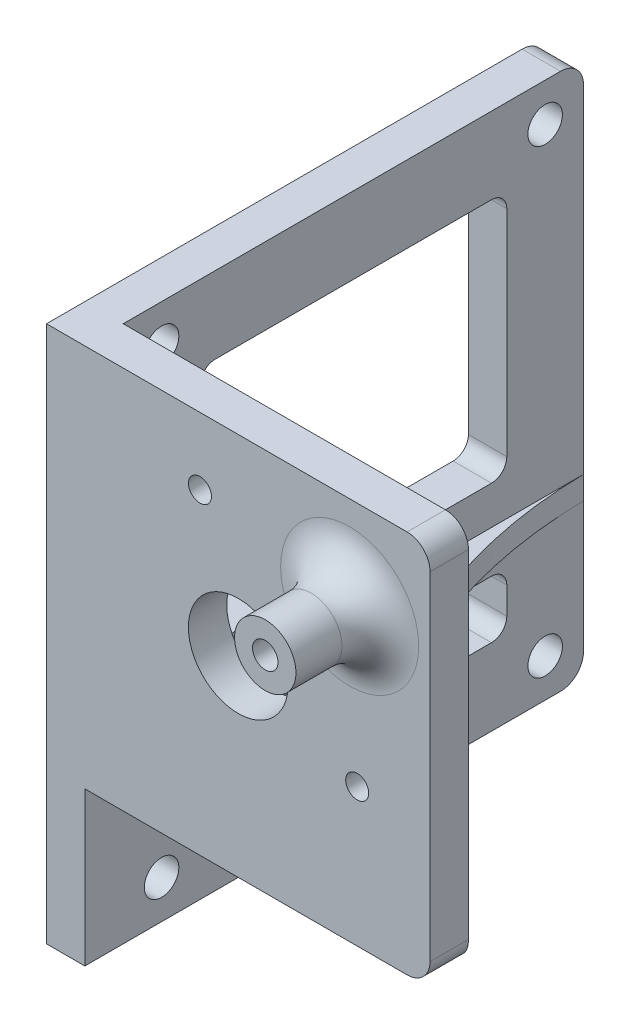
ISO-10303-21;
HEADER;
FILE_DESCRIPTION(('STEP AP214'),'2;1');
FILE_NAME('part.step','',(''),(''),'','','');
FILE_SCHEMA(('AUTOMOTIVE_DESIGN { 1 0 10303 214 1 1 1 1 }'));
ENDSEC;
DATA;
#1=APPLICATION_CONTEXT('core data for automotive mechanical design processes');
#2=APPLICATION_PROTOCOL_DEFINITION('international standard','automotive_design',2000,#1);
#3=PRODUCT_CONTEXT('',#1,'mechanical');
#4=PRODUCT('Part','Part','',(#3));
#5=PRODUCT_RELATED_PRODUCT_CATEGORY('part','',(#4));
#6=PRODUCT_DEFINITION_FORMATION('','',#4);
#7=PRODUCT_DEFINITION_CONTEXT('part definition',#1,'design');
#8=PRODUCT_DEFINITION('design','',#6,#7);
#9=PRODUCT_DEFINITION_SHAPE('','',#8);
#10=(LENGTH_UNIT() NAMED_UNIT(*) SI_UNIT(.MILLI.,.METRE.));
#11=(NAMED_UNIT(*) PLANE_ANGLE_UNIT() SI_UNIT($,.RADIAN.));
#12=(NAMED_UNIT(*) SI_UNIT($,.STERADIAN.) SOLID_ANGLE_UNIT());
#13=UNCERTAINTY_MEASURE_WITH_UNIT(LENGTH_MEASURE(1.E-05),#10,'distance_accuracy_value','');
#14=(GEOMETRIC_REPRESENTATION_CONTEXT(3) GLOBAL_UNCERTAINTY_ASSIGNED_CONTEXT((#13)) GLOBAL_UNIT_ASSIGNED_CONTEXT((#10,
#11,#12)) REPRESENTATION_CONTEXT('',''));
#15=CARTESIAN_POINT('',(0.,0.,0.));
#16=DIRECTION('',(0.,0.,1.));
#17=DIRECTION('',(1.,0.,0.));
#18=AXIS2_PLACEMENT_3D('',#15,#16,#17);
#19=CARTESIAN_POINT('',(-20.,-25.,4.99999999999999));
#20=DIRECTION('',(0.,0.,-1.));
#21=DIRECTION('',(-1.,0.,0.));
#22=AXIS2_PLACEMENT_3D('',#19,#20,#21);
#23=PLANE('',#22);
#24=CARTESIAN_POINT('',(14.5160694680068,12.8487,4.99999999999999));
#25=DIRECTION('',(0.,0.,-1.));
#26=DIRECTION('',(-1.,0.,0.));
#27=AXIS2_PLACEMENT_3D('',#24,#25,#26);
#28=CIRCLE('',#27,9.);
#29=CARTESIAN_POINT('',(5.51606946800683,12.8487,4.99999999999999));
#30=VERTEX_POINT('',#29);
#31=EDGE_CURVE('E1107',#30,#30,#28,.T.);
#32=ORIENTED_EDGE('',*,*,#31,.T.);
#33=EDGE_LOOP('',(#32));
#34=FACE_BOUND('',#33,.T.);
#35=CARTESIAN_POINT('',(-4.9969749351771,16.256698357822,4.99999999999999));
#36=DIRECTION('',(0.,0.,-1.));
#37=DIRECTION('',(-1.,0.,0.));
#38=AXIS2_PLACEMENT_3D('',#35,#36,#37);
#39=CIRCLE('',#38,1.49999999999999);
#40=CARTESIAN_POINT('',(-6.49697493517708,16.256698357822,4.99999999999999));
#41=VERTEX_POINT('',#40);
#42=EDGE_CURVE('E747',#41,#41,#39,.T.);
#43=ORIENTED_EDGE('',*,*,#42,.T.);
#44=EDGE_LOOP('',(#43));
#45=FACE_BOUND('',#44,.T.);
#46=CARTESIAN_POINT('',(15.5,-7.,4.99999999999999));
#47=DIRECTION('',(0.,0.,-1.));
#48=DIRECTION('',(-1.,0.,0.));
#49=AXIS2_PLACEMENT_3D('',#46,#47,#48);
#50=CIRCLE('',#49,1.49999999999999);
#51=CARTESIAN_POINT('',(14.,-7.,4.99999999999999));
#52=VERTEX_POINT('',#51);
#53=EDGE_CURVE('E809',#52,#52,#50,.T.);
#54=ORIENTED_EDGE('',*,*,#53,.T.);
#55=EDGE_LOOP('',(#54));
#56=FACE_BOUND('',#55,.T.);
#57=CARTESIAN_POINT('',(0.,0.,4.99999999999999));
#58=DIRECTION('',(0.,0.,-1.));
#59=DIRECTION('',(-1.,0.,0.));
#60=AXIS2_PLACEMENT_3D('',#57,#58,#59);
#61=CIRCLE('',#60,6.49999999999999);
#62=CARTESIAN_POINT('',(-6.49999999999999,0.,4.99999999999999));
#63=VERTEX_POINT('',#62);
#64=EDGE_CURVE('E803',#63,#63,#61,.T.);
#65=ORIENTED_EDGE('',*,*,#64,.T.);
#66=EDGE_LOOP('',(#65));
#67=FACE_BOUND('',#66,.T.);
#68=DIRECTION('',(0.,1.,0.));
#69=VECTOR('',#68,1.);
#70=CARTESIAN_POINT('',(25.,25.,4.99999999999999));
#71=LINE('',#70,#69);
#72=CARTESIAN_POINT('',(25.,-22.,4.99999999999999));
#73=VERTEX_POINT('',#72);
#74=CARTESIAN_POINT('',(25.,22.,4.99999999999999));
#75=VERTEX_POINT('',#74);
#76=EDGE_CURVE('E350',#73,#75,#71,.T.);
#77=ORIENTED_EDGE('',*,*,#76,.T.);
#78=CARTESIAN_POINT('',(22.,22.,4.99999999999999));
#79=DIRECTION('',(0.,0.,-1.));
#80=DIRECTION('',(-1.,0.,0.));
#81=AXIS2_PLACEMENT_3D('',#78,#79,#80);
#82=CIRCLE('',#81,3.);
#83=CARTESIAN_POINT('',(22.,25.,4.99999999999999));
#84=VERTEX_POINT('',#83);
#85=EDGE_CURVE('E706',#75,#84,#82,.F.);
#86=ORIENTED_EDGE('',*,*,#85,.T.);
#87=DIRECTION('',(-1.,0.,0.));
#88=VECTOR('',#87,1.);
#89=CARTESIAN_POINT('',(-20.,25.,4.99999999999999));
#90=LINE('',#89,#88);
#91=CARTESIAN_POINT('',(-25.,25.,4.99999999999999));
#92=VERTEX_POINT('',#91);
#93=EDGE_CURVE('E353',#84,#92,#90,.T.);
#94=ORIENTED_EDGE('',*,*,#93,.T.);
#95=DIRECTION('',(0.,1.,0.));
#96=VECTOR('',#95,1.);
#97=CARTESIAN_POINT('',(-25.,25.,4.99999999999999));
#98=LINE('',#97,#96);
#99=CARTESIAN_POINT('',(-25.,-45.,5.));
#100=VERTEX_POINT('',#99);
#101=EDGE_CURVE('E329',#100,#92,#98,.T.);
#102=ORIENTED_EDGE('',*,*,#101,.F.);
#103=DIRECTION('',(1.,0.,0.));
#104=VECTOR('',#103,1.);
#105=CARTESIAN_POINT('',(-25.,-45.,5.));
#106=LINE('',#105,#104);
#107=CARTESIAN_POINT('',(-20.,-45.,5.));
#108=VERTEX_POINT('',#107);
#109=EDGE_CURVE('E339',#100,#108,#106,.T.);
#110=ORIENTED_EDGE('',*,*,#109,.T.);
#111=DIRECTION('',(0.,1.,0.));
#112=VECTOR('',#111,1.);
#113=CARTESIAN_POINT('',(-20.,25.,4.99999999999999));
#114=LINE('',#113,#112);
#115=CARTESIAN_POINT('',(-20.,-25.,4.99999999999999));
#116=VERTEX_POINT('',#115);
#117=EDGE_CURVE('E341',#108,#116,#114,.T.);
#118=ORIENTED_EDGE('',*,*,#117,.T.);
#119=DIRECTION('',(1.,0.,0.));
#120=VECTOR('',#119,1.);
#121=CARTESIAN_POINT('',(25.,-25.,4.99999999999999));
#122=LINE('',#121,#120);
#123=CARTESIAN_POINT('',(22.,-25.,4.99999999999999));
#124=VERTEX_POINT('',#123);
#125=EDGE_CURVE('E354',#116,#124,#122,.T.);
#126=ORIENTED_EDGE('',*,*,#125,.T.);
#127=CARTESIAN_POINT('',(22.,-22.,4.99999999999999));
#128=DIRECTION('',(0.,0.,-1.));
#129=DIRECTION('',(-1.,0.,0.));
#130=AXIS2_PLACEMENT_3D('',#127,#128,#129);
#131=CIRCLE('',#130,3.);
#132=EDGE_CURVE('E707',#124,#73,#131,.F.);
#133=ORIENTED_EDGE('',*,*,#132,.T.);
#134=EDGE_LOOP('',(#77,#86,#94,#102,#110,#118,#126,#133));
#135=FACE_BOUND('',#134,.T.);
#136=ADVANCED_FACE('F43',(#34,#45,#56,#67,#135),#23,.F.);
#137=CARTESIAN_POINT('',(-20.,-22.,-60.0000000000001));
#138=DIRECTION('',(0.,0.,1.));
#139=DIRECTION('',(1.,0.,0.));
#140=AXIS2_PLACEMENT_3D('',#137,#138,#139);
#141=PLANE('',#140);
#142=DIRECTION('',(0.,-1.,0.));
#143=VECTOR('',#142,1.);
#144=CARTESIAN_POINT('',(-20.,-45.,-60.));
#145=LINE('',#144,#143);
#146=CARTESIAN_POINT('',(-20.,-25.,-60.));
#147=VERTEX_POINT('',#146);
#148=CARTESIAN_POINT('',(-20.,-42.,-60.));
#149=VERTEX_POINT('',#148);
#150=EDGE_CURVE('E330',#147,#149,#145,.T.);
#151=ORIENTED_EDGE('',*,*,#150,.T.);
#152=DIRECTION('',(1.,0.,0.));
#153=VECTOR('',#152,1.);
#154=CARTESIAN_POINT('',(-20.,-42.,-60.0000000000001));
#155=LINE('',#154,#153);
#156=CARTESIAN_POINT('',(-25.,-42.,-60.));
#157=VERTEX_POINT('',#156);
#158=EDGE_CURVE('E764',#149,#157,#155,.F.);
#159=ORIENTED_EDGE('',*,*,#158,.T.);
#160=DIRECTION('',(0.,-1.,0.));
#161=VECTOR('',#160,1.);
#162=CARTESIAN_POINT('',(-25.,-45.,-60.));
#163=LINE('',#162,#161);
#164=CARTESIAN_POINT('',(-25.,22.,-60.));
#165=VERTEX_POINT('',#164);
#166=EDGE_CURVE('E336',#165,#157,#163,.T.);
#167=ORIENTED_EDGE('',*,*,#166,.F.);
#168=DIRECTION('',(1.,0.,0.));
#169=VECTOR('',#168,1.);
#170=CARTESIAN_POINT('',(-20.,22.,-60.0000000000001));
#171=LINE('',#170,#169);
#172=CARTESIAN_POINT('',(-20.,22.,-60.));
#173=VERTEX_POINT('',#172);
#174=EDGE_CURVE('E733',#165,#173,#171,.T.);
#175=ORIENTED_EDGE('',*,*,#174,.T.);
#176=DIRECTION('',(0.,1.,0.));
#177=VECTOR('',#176,1.);
#178=CARTESIAN_POINT('',(-20.,-22.,-60.0000000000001));
#179=LINE('',#178,#177);
#180=CARTESIAN_POINT('',(-20.,-22.,-60.));
#181=VERTEX_POINT('',#180);
#182=EDGE_CURVE('E322',#181,#173,#179,.T.);
#183=ORIENTED_EDGE('',*,*,#182,.F.);
#184=DIRECTION('',(0.,1.,0.));
#185=VECTOR('',#184,1.);
#186=CARTESIAN_POINT('',(-20.,-25.,-60.));
#187=LINE('',#186,#185);
#188=EDGE_CURVE('E365',#147,#181,#187,.T.);
#189=ORIENTED_EDGE('',*,*,#188,.F.);
#190=EDGE_LOOP('',(#151,#159,#167,#175,#183,#189));
#191=FACE_BOUND('',#190,.T.);
#192=ADVANCED_FACE('F669',(#191),#141,.F.);
#193=CARTESIAN_POINT('',(-25.,-25.,5.));
#194=DIRECTION('',(0.,1.,0.));
#195=DIRECTION('',(-1.,0.,0.));
#196=AXIS2_PLACEMENT_3D('',#193,#194,#195);
#197=PLANE('',#196);
#198=DIRECTION('',(0.,0.,1.));
#199=VECTOR('',#198,1.);
#200=CARTESIAN_POINT('',(-18.,-25.,5.));
#201=LINE('',#200,#199);
#202=CARTESIAN_POINT('',(-18.,-25.,-23.11273842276));
#203=VERTEX_POINT('',#202);
#204=CARTESIAN_POINT('',(-18.,-25.,-4.));
#205=VERTEX_POINT('',#204);
#206=EDGE_CURVE('E306',#203,#205,#201,.T.);
#207=ORIENTED_EDGE('',*,*,#206,.T.);
#208=CARTESIAN_POINT('',(-16.,-25.,-4.));
#209=DIRECTION('',(0.,1.,0.));
#210=DIRECTION('',(-1.,0.,0.));
#211=AXIS2_PLACEMENT_3D('',#208,#209,#210);
#212=CIRCLE('',#211,2.);
#213=CARTESIAN_POINT('',(-16.,-25.,-2.));
#214=VERTEX_POINT('',#213);
#215=EDGE_CURVE('E772',#205,#214,#212,.T.);
#216=ORIENTED_EDGE('',*,*,#215,.T.);
#217=DIRECTION('',(1.,0.,0.));
#218=VECTOR('',#217,1.);
#219=CARTESIAN_POINT('',(-25.,-25.,-2.));
#220=LINE('',#219,#218);
#221=CARTESIAN_POINT('',(1.20029164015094,-25.,-2.));
#222=VERTEX_POINT('',#221);
#223=EDGE_CURVE('E309',#214,#222,#220,.T.);
#224=ORIENTED_EDGE('',*,*,#223,.T.);
#225=CARTESIAN_POINT('',(1.20029164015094,-25.,-4.));
#226=DIRECTION('',(0.,1.,0.));
#227=DIRECTION('',(-1.,0.,0.));
#228=AXIS2_PLACEMENT_3D('',#225,#226,#227);
#229=CIRCLE('',#228,2.);
#230=CARTESIAN_POINT('',(2.27035865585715,-25.,-5.68966167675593));
#231=VERTEX_POINT('',#230);
#232=EDGE_CURVE('E311',#222,#231,#229,.T.);
#233=ORIENTED_EDGE('',*,*,#232,.T.);
#234=CARTESIAN_POINT('',(26.6697969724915,-25.,-44.2169644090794));
#235=DIRECTION('',(0.,1.,0.));
#236=DIRECTION('',(-1.,0.,0.));
#237=AXIS2_PLACEMENT_3D('',#234,#235,#236);
#238=CIRCLE('',#237,45.6035705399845);
#239=CARTESIAN_POINT('',(-14.2072858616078,-25.,-23.9994040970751));
#240=VERTEX_POINT('',#239);
#241=EDGE_CURVE('E301',#231,#240,#238,.F.);
#242=ORIENTED_EDGE('',*,*,#241,.T.);
#243=CARTESIAN_POINT('',(-16.,-25.,-23.11273842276));
#244=DIRECTION('',(0.,1.,0.));
#245=DIRECTION('',(-1.,0.,0.));
#246=AXIS2_PLACEMENT_3D('',#243,#244,#245);
#247=CIRCLE('',#246,2.);
#248=EDGE_CURVE('E273',#240,#203,#247,.T.);
#249=ORIENTED_EDGE('',*,*,#248,.T.);
#250=EDGE_LOOP('',(#207,#216,#224,#233,#242,#249));
#251=FACE_BOUND('',#250,.T.);
#252=CARTESIAN_POINT('',(43.6964898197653,-25.,-60.897367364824));
#253=DIRECTION('',(0.,-1.,0.));
#254=DIRECTION('',(1.,0.,0.));
#255=AXIS2_PLACEMENT_3D('',#252,#253,#254);
#256=CIRCLE('',#255,63.7028106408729);
#257=CARTESIAN_POINT('',(22.,-25.,-1.00320727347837));
#258=VERTEX_POINT('',#257);
#259=EDGE_CURVE('E370',#258,#147,#256,.T.);
#260=ORIENTED_EDGE('',*,*,#259,.F.);
#261=DIRECTION('',(0.,0.,-1.));
#262=VECTOR('',#261,1.);
#263=CARTESIAN_POINT('',(22.,-25.,5.));
#264=LINE('',#263,#262);
#265=EDGE_CURVE('E622',#258,#124,#264,.F.);
#266=ORIENTED_EDGE('',*,*,#265,.T.);
#267=ORIENTED_EDGE('',*,*,#125,.F.);
#268=DIRECTION('',(0.,0.,1.));
#269=VECTOR('',#268,1.);
#270=CARTESIAN_POINT('',(-20.,-25.,5.));
#271=LINE('',#270,#269);
#272=EDGE_CURVE('E356',#116,#147,#271,.F.);
#273=ORIENTED_EDGE('',*,*,#272,.T.);
#274=EDGE_LOOP('',(#260,#266,#267,#273));
#275=FACE_BOUND('',#274,.T.);
#276=ADVANCED_FACE('F606',(#251,#275),#197,.F.);
#277=CARTESIAN_POINT('',(43.6964898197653,-22.,-60.897367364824));
#278=DIRECTION('',(0.,-1.,0.));
#279=DIRECTION('',(1.,0.,0.));
#280=AXIS2_PLACEMENT_3D('',#277,#278,#279);
#281=CYLINDRICAL_SURFACE('',#280,63.7028106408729);
#282=CARTESIAN_POINT('',(43.6964898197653,-22.,-60.897367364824));
#283=DIRECTION('',(0.,-1.,0.));
#284=DIRECTION('',(1.,0.,0.));
#285=AXIS2_PLACEMENT_3D('',#282,#283,#284);
#286=CIRCLE('',#285,63.7028106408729);
#287=CARTESIAN_POINT('',(25.,-22.,0.));
#288=VERTEX_POINT('',#287);
#289=EDGE_CURVE('E359',#288,#181,#286,.T.);
#290=ORIENTED_EDGE('',*,*,#289,.F.);
#291=CARTESIAN_POINT('',(25.,-22.,0.));
#292=CARTESIAN_POINT('',(25.0000099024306,-22.081560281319,1.79600558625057E-06));
#293=CARTESIAN_POINT('',(24.996674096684,-22.1631157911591,-0.00102113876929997));
#294=CARTESIAN_POINT('',(24.9833871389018,-22.3256250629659,-0.00510217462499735));
#295=CARTESIAN_POINT('',(24.9734368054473,-22.4065788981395,-0.00816002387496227));
#296=CARTESIAN_POINT('',(24.9470212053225,-22.5671648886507,-0.0162890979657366));
#297=CARTESIAN_POINT('',(24.9305679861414,-22.6467992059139,-0.0213565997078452));
#298=CARTESIAN_POINT('',(24.8913115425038,-22.8043102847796,-0.0334718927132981));
#299=CARTESIAN_POINT('',(24.8685083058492,-22.8821870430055,-0.0405196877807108));
#300=CARTESIAN_POINT('',(24.7908374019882,-23.1123786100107,-0.064585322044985));
#301=CARTESIAN_POINT('',(24.7266874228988,-23.261381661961,-0.0845318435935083));
#302=CARTESIAN_POINT('',(24.5759223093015,-23.5461670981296,-0.131767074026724));
#303=CARTESIAN_POINT('',(24.4893043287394,-23.6819478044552,-0.159056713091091));
#304=CARTESIAN_POINT('',(24.2948013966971,-23.9391485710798,-0.220904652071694));
#305=CARTESIAN_POINT('',(24.1865857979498,-24.0602913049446,-0.255576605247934));
#306=CARTESIAN_POINT('',(23.9532573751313,-24.2827143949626,-0.331140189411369));
#307=CARTESIAN_POINT('',(23.8281412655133,-24.3839908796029,-0.372033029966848));
#308=CARTESIAN_POINT('',(23.5591347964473,-24.5684232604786,-0.460988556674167));
#309=CARTESIAN_POINT('',(23.4146765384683,-24.6506391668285,-0.509280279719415));
#310=CARTESIAN_POINT('',(23.1155514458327,-24.7897602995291,-0.610569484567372));
#311=CARTESIAN_POINT('',(22.9608819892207,-24.8466589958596,-0.66356817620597));
#312=CARTESIAN_POINT('',(22.671891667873,-24.9269700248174,-0.76390220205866));
#313=CARTESIAN_POINT('',(22.5384781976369,-24.9543840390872,-0.810708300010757));
#314=CARTESIAN_POINT('',(22.2699861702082,-24.9908985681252,-0.905921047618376));
#315=CARTESIAN_POINT('',(22.1349108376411,-25.0000302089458,-0.954324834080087));
#316=CARTESIAN_POINT('',(22.,-25.,-1.00320727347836));
#317=B_SPLINE_CURVE_WITH_KNOTS('',3,(#291,#292,#293,#294,#295,#296,#297,#298,#299,#300,#301,
#302,#303,#304,#305,#306,#307,#308,#309,#310,#311,#312,#313,#314,#315,#316),.UNSPECIFIED.,.F.,
.F.,(4,2,2,2,2,2,2,2,2,2,2,2,4),(0.,0.24459790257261,0.489165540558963,0.733282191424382,
0.97739931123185,1.46525186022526,1.95316623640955,2.44921937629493,2.94536909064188,
3.46236218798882,3.97948855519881,4.41038656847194,4.84055034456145),.UNSPECIFIED.);
#318=EDGE_CURVE('E620',#288,#258,#317,.T.);
#319=ORIENTED_EDGE('',*,*,#318,.T.);
#320=ORIENTED_EDGE('',*,*,#259,.T.);
#321=ORIENTED_EDGE('',*,*,#188,.T.);
#322=EDGE_LOOP('',(#290,#319,#320,#321));
#323=FACE_BOUND('',#322,.T.);
#324=ADVANCED_FACE('F600',(#323),#281,.F.);
#325=CARTESIAN_POINT('',(25.,25.,4.99999999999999));
#326=DIRECTION('',(-1.,0.,0.));
#327=DIRECTION('',(0.,-1.,0.));
#328=AXIS2_PLACEMENT_3D('',#325,#326,#327);
#329=PLANE('',#328);
#330=DIRECTION('',(0.,-1.,0.));
#331=VECTOR('',#330,1.);
#332=CARTESIAN_POINT('',(25.,25.,0.));
#333=LINE('',#332,#331);
#334=CARTESIAN_POINT('',(25.,22.,0.));
#335=VERTEX_POINT('',#334);
#336=EDGE_CURVE('E314',#335,#288,#333,.T.);
#337=ORIENTED_EDGE('',*,*,#336,.F.);
#338=DIRECTION('',(0.,0.,-1.));
#339=VECTOR('',#338,1.);
#340=CARTESIAN_POINT('',(25.,22.,4.99999999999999));
#341=LINE('',#340,#339);
#342=EDGE_CURVE('E694',#335,#75,#341,.F.);
#343=ORIENTED_EDGE('',*,*,#342,.T.);
#344=ORIENTED_EDGE('',*,*,#76,.F.);
#345=DIRECTION('',(0.,0.,-1.));
#346=VECTOR('',#345,1.);
#347=CARTESIAN_POINT('',(25.,-22.,4.99999999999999));
#348=LINE('',#347,#346);
#349=EDGE_CURVE('E696',#73,#288,#348,.T.);
#350=ORIENTED_EDGE('',*,*,#349,.T.);
#351=EDGE_LOOP('',(#337,#343,#344,#350));
#352=FACE_BOUND('',#351,.T.);
#353=ADVANCED_FACE('F605',(#352),#329,.F.);
#354=CARTESIAN_POINT('',(-20.,25.,4.99999999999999));
#355=DIRECTION('',(0.,-1.,0.));
#356=DIRECTION('',(1.,0.,0.));
#357=AXIS2_PLACEMENT_3D('',#354,#355,#356);
#358=PLANE('',#357);
#359=ORIENTED_EDGE('',*,*,#93,.F.);
#360=DIRECTION('',(0.,0.,-1.));
#361=VECTOR('',#360,1.);
#362=CARTESIAN_POINT('',(22.,25.,4.99999999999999));
#363=LINE('',#362,#361);
#364=CARTESIAN_POINT('',(22.,25.,0.));
#365=VERTEX_POINT('',#364);
#366=EDGE_CURVE('E751',#84,#365,#363,.T.);
#367=ORIENTED_EDGE('',*,*,#366,.T.);
#368=DIRECTION('',(1.,0.,0.));
#369=VECTOR('',#368,1.);
#370=CARTESIAN_POINT('',(-20.,25.,0.));
#371=LINE('',#370,#369);
#372=CARTESIAN_POINT('',(-20.,25.,0.));
#373=VERTEX_POINT('',#372);
#374=EDGE_CURVE('E323',#373,#365,#371,.T.);
#375=ORIENTED_EDGE('',*,*,#374,.F.);
#376=DIRECTION('',(0.,0.,1.));
#377=VECTOR('',#376,1.);
#378=CARTESIAN_POINT('',(-20.,25.,-60.));
#379=LINE('',#378,#377);
#380=CARTESIAN_POINT('',(-20.,25.,-57.0000000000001));
#381=VERTEX_POINT('',#380);
#382=EDGE_CURVE('E319',#381,#373,#379,.T.);
#383=ORIENTED_EDGE('',*,*,#382,.F.);
#384=DIRECTION('',(1.,0.,0.));
#385=VECTOR('',#384,1.);
#386=CARTESIAN_POINT('',(-20.,25.,-57.0000000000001));
#387=LINE('',#386,#385);
#388=CARTESIAN_POINT('',(-25.,25.,-57.0000000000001));
#389=VERTEX_POINT('',#388);
#390=EDGE_CURVE('E753',#381,#389,#387,.F.);
#391=ORIENTED_EDGE('',*,*,#390,.T.);
#392=DIRECTION('',(0.,0.,-1.));
#393=VECTOR('',#392,1.);
#394=CARTESIAN_POINT('',(-25.,25.,-60.));
#395=LINE('',#394,#393);
#396=EDGE_CURVE('E333',#92,#389,#395,.T.);
#397=ORIENTED_EDGE('',*,*,#396,.F.);
#398=EDGE_LOOP('',(#359,#367,#375,#383,#391,#397));
#399=FACE_BOUND('',#398,.T.);
#400=ADVANCED_FACE('F681',(#399),#358,.F.);
#401=CARTESIAN_POINT('',(-20.,-45.,-60.));
#402=DIRECTION('',(1.,0.,0.));
#403=DIRECTION('',(0.,1.,0.));
#404=AXIS2_PLACEMENT_3D('',#401,#402,#403);
#405=PLANE('',#404);
#406=DIRECTION('',(0.,-1.,0.));
#407=VECTOR('',#406,1.);
#408=CARTESIAN_POINT('',(-20.,-27.5,-10.));
#409=LINE('',#408,#407);
#410=CARTESIAN_POINT('',(-20.,-29.5,-10.));
#411=VERTEX_POINT('',#410);
#412=CARTESIAN_POINT('',(-20.,-33.,-10.));
#413=VERTEX_POINT('',#412);
#414=EDGE_CURVE('E872',#411,#413,#409,.T.);
#415=ORIENTED_EDGE('',*,*,#414,.F.);
#416=CARTESIAN_POINT('',(-20.,-29.5,-12.));
#417=DIRECTION('',(1.,0.,0.));
#418=DIRECTION('',(0.,1.,0.));
#419=AXIS2_PLACEMENT_3D('',#416,#417,#418);
#420=CIRCLE('',#419,2.);
#421=CARTESIAN_POINT('',(-20.,-27.5,-12.));
#422=VERTEX_POINT('',#421);
#423=EDGE_CURVE('E900',#411,#422,#420,.F.);
#424=ORIENTED_EDGE('',*,*,#423,.T.);
#425=DIRECTION('',(0.,0.,1.));
#426=VECTOR('',#425,1.);
#427=CARTESIAN_POINT('',(-20.,-27.5,-10.));
#428=LINE('',#427,#426);
#429=CARTESIAN_POINT('',(-20.,-27.5,-48.));
#430=VERTEX_POINT('',#429);
#431=EDGE_CURVE('E862',#430,#422,#428,.T.);
#432=ORIENTED_EDGE('',*,*,#431,.F.);
#433=CARTESIAN_POINT('',(-20.,-29.5,-48.));
#434=DIRECTION('',(1.,0.,0.));
#435=DIRECTION('',(0.,1.,0.));
#436=AXIS2_PLACEMENT_3D('',#433,#434,#435);
#437=CIRCLE('',#436,2.);
#438=CARTESIAN_POINT('',(-20.,-29.5,-50.));
#439=VERTEX_POINT('',#438);
#440=EDGE_CURVE('E933',#430,#439,#437,.F.);
#441=ORIENTED_EDGE('',*,*,#440,.T.);
#442=DIRECTION('',(0.,1.,0.));
#443=VECTOR('',#442,1.);
#444=CARTESIAN_POINT('',(-20.,-27.5,-50.));
#445=LINE('',#444,#443);
#446=CARTESIAN_POINT('',(-20.,-33.,-50.));
#447=VERTEX_POINT('',#446);
#448=EDGE_CURVE('E866',#447,#439,#445,.T.);
#449=ORIENTED_EDGE('',*,*,#448,.F.);
#450=CARTESIAN_POINT('',(-20.,-33.,-48.));
#451=DIRECTION('',(1.,0.,0.));
#452=DIRECTION('',(0.,1.,0.));
#453=AXIS2_PLACEMENT_3D('',#450,#451,#452);
#454=CIRCLE('',#453,2.);
#455=CARTESIAN_POINT('',(-20.,-35.,-48.));
#456=VERTEX_POINT('',#455);
#457=EDGE_CURVE('E943',#447,#456,#454,.F.);
#458=ORIENTED_EDGE('',*,*,#457,.T.);
#459=DIRECTION('',(0.,0.,-1.));
#460=VECTOR('',#459,1.);
#461=CARTESIAN_POINT('',(-20.,-35.,-10.));
#462=LINE('',#461,#460);
#463=CARTESIAN_POINT('',(-20.,-35.,-12.));
#464=VERTEX_POINT('',#463);
#465=EDGE_CURVE('E869',#464,#456,#462,.T.);
#466=ORIENTED_EDGE('',*,*,#465,.F.);
#467=CARTESIAN_POINT('',(-20.,-33.,-12.));
#468=DIRECTION('',(1.,0.,0.));
#469=DIRECTION('',(0.,1.,0.));
#470=AXIS2_PLACEMENT_3D('',#467,#468,#469);
#471=CIRCLE('',#470,2.);
#472=EDGE_CURVE('E901',#464,#413,#471,.F.);
#473=ORIENTED_EDGE('',*,*,#472,.T.);
#474=EDGE_LOOP('',(#415,#424,#432,#441,#449,#458,#466,#473));
#475=FACE_BOUND('',#474,.T.);
#476=CARTESIAN_POINT('',(-20.,-40.,-55.));
#477=DIRECTION('',(1.,0.,0.));
#478=DIRECTION('',(0.,0.,-1.));
#479=AXIS2_PLACEMENT_3D('',#476,#477,#478);
#480=CIRCLE('',#479,2.25);
#481=CARTESIAN_POINT('',(-20.,-40.,-57.25));
#482=VERTEX_POINT('',#481);
#483=EDGE_CURVE('E827',#482,#482,#480,.T.);
#484=ORIENTED_EDGE('',*,*,#483,.F.);
#485=EDGE_LOOP('',(#484));
#486=FACE_BOUND('',#485,.T.);
#487=CARTESIAN_POINT('',(-20.,-40.,-5.));
#488=DIRECTION('',(1.,0.,0.));
#489=DIRECTION('',(0.,0.,-1.));
#490=AXIS2_PLACEMENT_3D('',#487,#488,#489);
#491=CIRCLE('',#490,2.25);
#492=CARTESIAN_POINT('',(-20.,-40.,-7.25000000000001));
#493=VERTEX_POINT('',#492);
#494=EDGE_CURVE('E821',#493,#493,#491,.T.);
#495=ORIENTED_EDGE('',*,*,#494,.F.);
#496=EDGE_LOOP('',(#495));
#497=FACE_BOUND('',#496,.T.);
#498=DIRECTION('',(0.,0.,1.));
#499=VECTOR('',#498,1.);
#500=CARTESIAN_POINT('',(-20.,-45.,5.));
#501=LINE('',#500,#499);
#502=CARTESIAN_POINT('',(-20.,-45.,-57.0000000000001));
#503=VERTEX_POINT('',#502);
#504=EDGE_CURVE('E326',#503,#108,#501,.T.);
#505=ORIENTED_EDGE('',*,*,#504,.F.);
#506=CARTESIAN_POINT('',(-20.,-42.,-57.0000000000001));
#507=DIRECTION('',(1.,0.,0.));
#508=DIRECTION('',(0.,1.,0.));
#509=AXIS2_PLACEMENT_3D('',#506,#507,#508);
#510=CIRCLE('',#509,3.);
#511=EDGE_CURVE('E767',#503,#149,#510,.T.);
#512=ORIENTED_EDGE('',*,*,#511,.T.);
#513=ORIENTED_EDGE('',*,*,#150,.F.);
#514=ORIENTED_EDGE('',*,*,#272,.F.);
#515=ORIENTED_EDGE('',*,*,#117,.F.);
#516=EDGE_LOOP('',(#505,#512,#513,#514,#515));
#517=FACE_BOUND('',#516,.T.);
#518=ADVANCED_FACE('F683',(#475,#486,#497,#517),#405,.T.);
#519=CARTESIAN_POINT('',(-25.,-45.,5.));
#520=DIRECTION('',(0.,1.,0.));
#521=DIRECTION('',(-1.,0.,0.));
#522=AXIS2_PLACEMENT_3D('',#519,#520,#521);
#523=PLANE('',#522);
#524=DIRECTION('',(0.,0.,1.));
#525=VECTOR('',#524,1.);
#526=CARTESIAN_POINT('',(-25.,-45.,5.));
#527=LINE('',#526,#525);
#528=CARTESIAN_POINT('',(-25.,-45.,-57.0000000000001));
#529=VERTEX_POINT('',#528);
#530=EDGE_CURVE('E327',#529,#100,#527,.T.);
#531=ORIENTED_EDGE('',*,*,#530,.F.);
#532=DIRECTION('',(1.,0.,0.));
#533=VECTOR('',#532,1.);
#534=CARTESIAN_POINT('',(-25.,-45.,-57.0000000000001));
#535=LINE('',#534,#533);
#536=EDGE_CURVE('E769',#529,#503,#535,.T.);
#537=ORIENTED_EDGE('',*,*,#536,.T.);
#538=ORIENTED_EDGE('',*,*,#504,.T.);
#539=ORIENTED_EDGE('',*,*,#109,.F.);
#540=EDGE_LOOP('',(#531,#537,#538,#539));
#541=FACE_BOUND('',#540,.T.);
#542=ADVANCED_FACE('F1076',(#541),#523,.F.);
#543=CARTESIAN_POINT('',(-25.,-45.,-60.));
#544=DIRECTION('',(1.,0.,0.));
#545=DIRECTION('',(0.,1.,0.));
#546=AXIS2_PLACEMENT_3D('',#543,#544,#545);
#547=PLANE('',#546);
#548=DIRECTION('',(0.,1.,0.));
#549=VECTOR('',#548,1.);
#550=CARTESIAN_POINT('',(-25.,-27.5,-50.));
#551=LINE('',#550,#549);
#552=CARTESIAN_POINT('',(-25.,-33.,-50.));
#553=VERTEX_POINT('',#552);
#554=CARTESIAN_POINT('',(-25.,-29.5,-50.));
#555=VERTEX_POINT('',#554);
#556=EDGE_CURVE('E877',#553,#555,#551,.T.);
#557=ORIENTED_EDGE('',*,*,#556,.T.);
#558=CARTESIAN_POINT('',(-25.,-29.5,-48.));
#559=DIRECTION('',(1.,0.,0.));
#560=DIRECTION('',(0.,1.,0.));
#561=AXIS2_PLACEMENT_3D('',#558,#559,#560);
#562=CIRCLE('',#561,2.);
#563=CARTESIAN_POINT('',(-25.,-27.5,-48.));
#564=VERTEX_POINT('',#563);
#565=EDGE_CURVE('E941',#555,#564,#562,.T.);
#566=ORIENTED_EDGE('',*,*,#565,.T.);
#567=DIRECTION('',(0.,0.,1.));
#568=VECTOR('',#567,1.);
#569=CARTESIAN_POINT('',(-25.,-27.5,-10.));
#570=LINE('',#569,#568);
#571=CARTESIAN_POINT('',(-25.,-27.5,-12.));
#572=VERTEX_POINT('',#571);
#573=EDGE_CURVE('E853',#564,#572,#570,.T.);
#574=ORIENTED_EDGE('',*,*,#573,.T.);
#575=CARTESIAN_POINT('',(-25.,-29.5,-12.));
#576=DIRECTION('',(1.,0.,0.));
#577=DIRECTION('',(0.,1.,0.));
#578=AXIS2_PLACEMENT_3D('',#575,#576,#577);
#579=CIRCLE('',#578,2.);
#580=CARTESIAN_POINT('',(-25.,-29.5,-10.));
#581=VERTEX_POINT('',#580);
#582=EDGE_CURVE('E891',#572,#581,#579,.T.);
#583=ORIENTED_EDGE('',*,*,#582,.T.);
#584=DIRECTION('',(0.,-1.,0.));
#585=VECTOR('',#584,1.);
#586=CARTESIAN_POINT('',(-25.,-27.5,-10.));
#587=LINE('',#586,#585);
#588=CARTESIAN_POINT('',(-25.,-33.,-10.));
#589=VERTEX_POINT('',#588);
#590=EDGE_CURVE('E865',#581,#589,#587,.T.);
#591=ORIENTED_EDGE('',*,*,#590,.T.);
#592=CARTESIAN_POINT('',(-25.,-33.,-12.));
#593=DIRECTION('',(1.,0.,0.));
#594=DIRECTION('',(0.,1.,0.));
#595=AXIS2_PLACEMENT_3D('',#592,#593,#594);
#596=CIRCLE('',#595,2.);
#597=CARTESIAN_POINT('',(-25.,-35.,-12.));
#598=VERTEX_POINT('',#597);
#599=EDGE_CURVE('E888',#589,#598,#596,.T.);
#600=ORIENTED_EDGE('',*,*,#599,.T.);
#601=DIRECTION('',(0.,0.,-1.));
#602=VECTOR('',#601,1.);
#603=CARTESIAN_POINT('',(-25.,-35.,-10.));
#604=LINE('',#603,#602);
#605=CARTESIAN_POINT('',(-25.,-35.,-48.));
#606=VERTEX_POINT('',#605);
#607=EDGE_CURVE('E880',#598,#606,#604,.T.);
#608=ORIENTED_EDGE('',*,*,#607,.T.);
#609=CARTESIAN_POINT('',(-25.,-33.,-48.));
#610=DIRECTION('',(1.,0.,0.));
#611=DIRECTION('',(0.,1.,0.));
#612=AXIS2_PLACEMENT_3D('',#609,#610,#611);
#613=CIRCLE('',#612,2.);
#614=EDGE_CURVE('E904',#606,#553,#613,.T.);
#615=ORIENTED_EDGE('',*,*,#614,.T.);
#616=EDGE_LOOP('',(#557,#566,#574,#583,#591,#600,#608,#615));
#617=FACE_BOUND('',#616,.T.);
#618=DIRECTION('',(0.,1.,0.));
#619=VECTOR('',#618,1.);
#620=CARTESIAN_POINT('',(-25.,15.,-50.));
#621=LINE('',#620,#619);
#622=CARTESIAN_POINT('',(-25.,-15.,-50.));
#623=VERTEX_POINT('',#622);
#624=CARTESIAN_POINT('',(-25.,13.,-50.));
#625=VERTEX_POINT('',#624);
#626=EDGE_CURVE('E855',#623,#625,#621,.T.);
#627=ORIENTED_EDGE('',*,*,#626,.T.);
#628=CARTESIAN_POINT('',(-25.,13.,-48.));
#629=DIRECTION('',(1.,0.,0.));
#630=DIRECTION('',(0.,1.,0.));
#631=AXIS2_PLACEMENT_3D('',#628,#629,#630);
#632=CIRCLE('',#631,2.);
#633=CARTESIAN_POINT('',(-25.,15.,-48.));
#634=VERTEX_POINT('',#633);
#635=EDGE_CURVE('E65',#625,#634,#632,.T.);
#636=ORIENTED_EDGE('',*,*,#635,.T.);
#637=DIRECTION('',(0.,0.,1.));
#638=VECTOR('',#637,1.);
#639=CARTESIAN_POINT('',(-25.,15.,-10.));
#640=LINE('',#639,#638);
#641=CARTESIAN_POINT('',(-25.,15.,-12.));
#642=VERTEX_POINT('',#641);
#643=EDGE_CURVE('E840',#634,#642,#640,.T.);
#644=ORIENTED_EDGE('',*,*,#643,.T.);
#645=CARTESIAN_POINT('',(-25.,13.,-12.));
#646=DIRECTION('',(1.,0.,0.));
#647=DIRECTION('',(0.,1.,0.));
#648=AXIS2_PLACEMENT_3D('',#645,#646,#647);
#649=CIRCLE('',#648,2.);
#650=CARTESIAN_POINT('',(-25.,13.,-10.));
#651=VERTEX_POINT('',#650);
#652=EDGE_CURVE('E13',#642,#651,#649,.T.);
#653=ORIENTED_EDGE('',*,*,#652,.T.);
#654=DIRECTION('',(0.,-1.,0.));
#655=VECTOR('',#654,1.);
#656=CARTESIAN_POINT('',(-25.,15.,-10.));
#657=LINE('',#656,#655);
#658=CARTESIAN_POINT('',(-25.,-15.,-10.));
#659=VERTEX_POINT('',#658);
#660=EDGE_CURVE('E843',#651,#659,#657,.T.);
#661=ORIENTED_EDGE('',*,*,#660,.T.);
#662=CARTESIAN_POINT('',(-25.,-15.,-12.));
#663=DIRECTION('',(1.,0.,0.));
#664=DIRECTION('',(0.,1.,0.));
#665=AXIS2_PLACEMENT_3D('',#662,#663,#664);
#666=CIRCLE('',#665,2.);
#667=CARTESIAN_POINT('',(-25.,-17.,-12.));
#668=VERTEX_POINT('',#667);
#669=EDGE_CURVE('E911',#659,#668,#666,.T.);
#670=ORIENTED_EDGE('',*,*,#669,.T.);
#671=DIRECTION('',(0.,0.,-1.));
#672=VECTOR('',#671,1.);
#673=CARTESIAN_POINT('',(-25.,-17.,-10.));
#674=LINE('',#673,#672);
#675=CARTESIAN_POINT('',(-25.,-17.,-48.));
#676=VERTEX_POINT('',#675);
#677=EDGE_CURVE('E857',#668,#676,#674,.T.);
#678=ORIENTED_EDGE('',*,*,#677,.T.);
#679=CARTESIAN_POINT('',(-25.,-15.,-48.));
#680=DIRECTION('',(1.,0.,0.));
#681=DIRECTION('',(0.,1.,0.));
#682=AXIS2_PLACEMENT_3D('',#679,#680,#681);
#683=CIRCLE('',#682,2.);
#684=EDGE_CURVE('E915',#676,#623,#683,.T.);
#685=ORIENTED_EDGE('',*,*,#684,.T.);
#686=EDGE_LOOP('',(#627,#636,#644,#653,#661,#670,#678,#685));
#687=FACE_BOUND('',#686,.T.);
#688=CARTESIAN_POINT('',(-25.,20.,-5.));
#689=DIRECTION('',(1.,0.,0.));
#690=DIRECTION('',(0.,1.,0.));
#691=AXIS2_PLACEMENT_3D('',#688,#689,#690);
#692=CIRCLE('',#691,2.25);
#693=CARTESIAN_POINT('',(-25.,22.25,-5.));
#694=VERTEX_POINT('',#693);
#695=EDGE_CURVE('E834',#694,#694,#692,.T.);
#696=ORIENTED_EDGE('',*,*,#695,.T.);
#697=EDGE_LOOP('',(#696));
#698=FACE_BOUND('',#697,.T.);
#699=CARTESIAN_POINT('',(-25.,20.,-55.));
#700=DIRECTION('',(1.,0.,0.));
#701=DIRECTION('',(0.,1.,0.));
#702=AXIS2_PLACEMENT_3D('',#699,#700,#701);
#703=CIRCLE('',#702,2.25);
#704=CARTESIAN_POINT('',(-25.,22.25,-55.));
#705=VERTEX_POINT('',#704);
#706=EDGE_CURVE('E830',#705,#705,#703,.T.);
#707=ORIENTED_EDGE('',*,*,#706,.T.);
#708=EDGE_LOOP('',(#707));
#709=FACE_BOUND('',#708,.T.);
#710=CARTESIAN_POINT('',(-25.,-40.,-55.));
#711=DIRECTION('',(1.,0.,0.));
#712=DIRECTION('',(0.,1.,0.));
#713=AXIS2_PLACEMENT_3D('',#710,#711,#712);
#714=CIRCLE('',#713,2.25);
#715=CARTESIAN_POINT('',(-25.,-37.75,-55.));
#716=VERTEX_POINT('',#715);
#717=EDGE_CURVE('E824',#716,#716,#714,.T.);
#718=ORIENTED_EDGE('',*,*,#717,.T.);
#719=EDGE_LOOP('',(#718));
#720=FACE_BOUND('',#719,.T.);
#721=CARTESIAN_POINT('',(-25.,-40.,-5.));
#722=DIRECTION('',(1.,0.,0.));
#723=DIRECTION('',(0.,1.,0.));
#724=AXIS2_PLACEMENT_3D('',#721,#722,#723);
#725=CIRCLE('',#724,2.25);
#726=CARTESIAN_POINT('',(-25.,-37.75,-5.));
#727=VERTEX_POINT('',#726);
#728=EDGE_CURVE('E818',#727,#727,#725,.T.);
#729=ORIENTED_EDGE('',*,*,#728,.T.);
#730=EDGE_LOOP('',(#729));
#731=FACE_BOUND('',#730,.T.);
#732=ORIENTED_EDGE('',*,*,#166,.T.);
#733=CARTESIAN_POINT('',(-25.,-42.,-57.0000000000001));
#734=DIRECTION('',(1.,0.,0.));
#735=DIRECTION('',(0.,1.,0.));
#736=AXIS2_PLACEMENT_3D('',#733,#734,#735);
#737=CIRCLE('',#736,3.);
#738=EDGE_CURVE('E756',#157,#529,#737,.F.);
#739=ORIENTED_EDGE('',*,*,#738,.T.);
#740=ORIENTED_EDGE('',*,*,#530,.T.);
#741=ORIENTED_EDGE('',*,*,#101,.T.);
#742=ORIENTED_EDGE('',*,*,#396,.T.);
#743=CARTESIAN_POINT('',(-25.,22.,-57.0000000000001));
#744=DIRECTION('',(1.,0.,0.));
#745=DIRECTION('',(0.,1.,0.));
#746=AXIS2_PLACEMENT_3D('',#743,#744,#745);
#747=CIRCLE('',#746,3.);
#748=EDGE_CURVE('E760',#389,#165,#747,.F.);
#749=ORIENTED_EDGE('',*,*,#748,.T.);
#750=EDGE_LOOP('',(#732,#739,#740,#741,#742,#749));
#751=FACE_BOUND('',#750,.T.);
#752=ADVANCED_FACE('F887',(#617,#687,#698,#709,#720,#731,#751),#547,.F.);
#753=CARTESIAN_POINT('',(-20.,-22.,0.));
#754=DIRECTION('',(0.,-1.,0.));
#755=DIRECTION('',(1.,0.,0.));
#756=AXIS2_PLACEMENT_3D('',#753,#754,#755);
#757=PLANE('',#756);
#758=CARTESIAN_POINT('',(26.6697969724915,-22.,-44.2169644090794));
#759=DIRECTION('',(0.,-1.,0.));
#760=DIRECTION('',(1.,0.,0.));
#761=AXIS2_PLACEMENT_3D('',#758,#759,#760);
#762=CIRCLE('',#761,45.6035705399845);
#763=CARTESIAN_POINT('',(2.27035865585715,-22.,-5.68966167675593));
#764=VERTEX_POINT('',#763);
#765=CARTESIAN_POINT('',(-14.2072858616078,-22.,-23.9994040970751));
#766=VERTEX_POINT('',#765);
#767=EDGE_CURVE('E281',#764,#766,#762,.T.);
#768=ORIENTED_EDGE('',*,*,#767,.F.);
#769=CARTESIAN_POINT('',(1.20029164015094,-22.,-4.));
#770=DIRECTION('',(0.,1.,0.));
#771=DIRECTION('',(-1.,0.,0.));
#772=AXIS2_PLACEMENT_3D('',#769,#770,#771);
#773=CIRCLE('',#772,2.);
#774=CARTESIAN_POINT('',(1.20029164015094,-22.,-2.));
#775=VERTEX_POINT('',#774);
#776=EDGE_CURVE('E286',#775,#764,#773,.T.);
#777=ORIENTED_EDGE('',*,*,#776,.F.);
#778=DIRECTION('',(1.,0.,0.));
#779=VECTOR('',#778,1.);
#780=CARTESIAN_POINT('',(-18.,-22.,-2.));
#781=LINE('',#780,#779);
#782=CARTESIAN_POINT('',(-16.,-22.,-2.));
#783=VERTEX_POINT('',#782);
#784=EDGE_CURVE('E293',#783,#775,#781,.T.);
#785=ORIENTED_EDGE('',*,*,#784,.F.);
#786=CARTESIAN_POINT('',(-16.,-22.,-4.));
#787=DIRECTION('',(0.,-1.,0.));
#788=DIRECTION('',(1.,0.,0.));
#789=AXIS2_PLACEMENT_3D('',#786,#787,#788);
#790=CIRCLE('',#789,2.);
#791=CARTESIAN_POINT('',(-18.,-22.,-4.));
#792=VERTEX_POINT('',#791);
#793=EDGE_CURVE('E774',#783,#792,#790,.T.);
#794=ORIENTED_EDGE('',*,*,#793,.T.);
#795=DIRECTION('',(0.,0.,1.));
#796=VECTOR('',#795,1.);
#797=CARTESIAN_POINT('',(-18.,-22.,-23.11273842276));
#798=LINE('',#797,#796);
#799=CARTESIAN_POINT('',(-18.,-22.,-23.11273842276));
#800=VERTEX_POINT('',#799);
#801=EDGE_CURVE('E291',#800,#792,#798,.T.);
#802=ORIENTED_EDGE('',*,*,#801,.F.);
#803=CARTESIAN_POINT('',(-16.,-22.,-23.11273842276));
#804=DIRECTION('',(0.,1.,0.));
#805=DIRECTION('',(-1.,0.,0.));
#806=AXIS2_PLACEMENT_3D('',#803,#804,#805);
#807=CIRCLE('',#806,2.);
#808=EDGE_CURVE('E270',#766,#800,#807,.T.);
#809=ORIENTED_EDGE('',*,*,#808,.F.);
#810=EDGE_LOOP('',(#768,#777,#785,#794,#802,#809));
#811=FACE_BOUND('',#810,.T.);
#812=DIRECTION('',(0.,0.,-1.));
#813=VECTOR('',#812,1.);
#814=CARTESIAN_POINT('',(-20.,-22.,0.));
#815=LINE('',#814,#813);
#816=CARTESIAN_POINT('',(-20.,-22.,0.));
#817=VERTEX_POINT('',#816);
#818=EDGE_CURVE('E318',#817,#181,#815,.T.);
#819=ORIENTED_EDGE('',*,*,#818,.F.);
#820=DIRECTION('',(1.,0.,0.));
#821=VECTOR('',#820,1.);
#822=CARTESIAN_POINT('',(-20.,-22.,0.));
#823=LINE('',#822,#821);
#824=EDGE_CURVE('E321',#817,#288,#823,.T.);
#825=ORIENTED_EDGE('',*,*,#824,.T.);
#826=ORIENTED_EDGE('',*,*,#289,.T.);
#827=EDGE_LOOP('',(#819,#825,#826));
#828=FACE_BOUND('',#827,.T.);
#829=ADVANCED_FACE('F288',(#811,#828),#757,.F.);
#830=CARTESIAN_POINT('',(-20.,25.,0.));
#831=DIRECTION('',(0.,0.,1.));
#832=DIRECTION('',(1.,0.,0.));
#833=AXIS2_PLACEMENT_3D('',#830,#831,#832);
#834=PLANE('',#833);
#835=CARTESIAN_POINT('',(-4.9969749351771,16.256698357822,0.));
#836=DIRECTION('',(0.,0.,-1.));
#837=DIRECTION('',(-1.,0.,0.));
#838=AXIS2_PLACEMENT_3D('',#835,#836,#837);
#839=CIRCLE('',#838,1.49999999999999);
#840=CARTESIAN_POINT('',(-6.49697493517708,16.256698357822,0.));
#841=VERTEX_POINT('',#840);
#842=EDGE_CURVE('E815',#841,#841,#839,.T.);
#843=ORIENTED_EDGE('',*,*,#842,.F.);
#844=EDGE_LOOP('',(#843));
#845=FACE_BOUND('',#844,.T.);
#846=CARTESIAN_POINT('',(15.5,-7.,0.));
#847=DIRECTION('',(0.,0.,-1.));
#848=DIRECTION('',(-1.,0.,0.));
#849=AXIS2_PLACEMENT_3D('',#846,#847,#848);
#850=CIRCLE('',#849,1.49999999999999);
#851=CARTESIAN_POINT('',(14.,-7.,0.));
#852=VERTEX_POINT('',#851);
#853=EDGE_CURVE('E812',#852,#852,#850,.T.);
#854=ORIENTED_EDGE('',*,*,#853,.F.);
#855=EDGE_LOOP('',(#854));
#856=FACE_BOUND('',#855,.T.);
#857=CARTESIAN_POINT('',(0.,0.,0.));
#858=DIRECTION('',(0.,0.,-1.));
#859=DIRECTION('',(-1.,0.,0.));
#860=AXIS2_PLACEMENT_3D('',#857,#858,#859);
#861=CIRCLE('',#860,6.49999999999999);
#862=CARTESIAN_POINT('',(-6.49999999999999,0.,0.));
#863=VERTEX_POINT('',#862);
#864=EDGE_CURVE('E806',#863,#863,#861,.T.);
#865=ORIENTED_EDGE('',*,*,#864,.F.);
#866=EDGE_LOOP('',(#865));
#867=FACE_BOUND('',#866,.T.);
#868=CARTESIAN_POINT('',(14.5160694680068,12.8487,0.));
#869=DIRECTION('',(0.,0.,-1.));
#870=DIRECTION('',(-1.,0.,0.));
#871=AXIS2_PLACEMENT_3D('',#868,#869,#870);
#872=CIRCLE('',#871,1.65);
#873=CARTESIAN_POINT('',(12.8660694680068,12.8487,0.));
#874=VERTEX_POINT('',#873);
#875=EDGE_CURVE('E794',#874,#874,#872,.T.);
#876=ORIENTED_EDGE('',*,*,#875,.F.);
#877=EDGE_LOOP('',(#876));
#878=FACE_BOUND('',#877,.T.);
#879=ORIENTED_EDGE('',*,*,#374,.T.);
#880=CARTESIAN_POINT('',(22.,22.,0.));
#881=DIRECTION('',(0.,0.,1.));
#882=DIRECTION('',(1.,0.,0.));
#883=AXIS2_PLACEMENT_3D('',#880,#881,#882);
#884=CIRCLE('',#883,3.);
#885=EDGE_CURVE('E704',#365,#335,#884,.F.);
#886=ORIENTED_EDGE('',*,*,#885,.T.);
#887=ORIENTED_EDGE('',*,*,#336,.T.);
#888=ORIENTED_EDGE('',*,*,#824,.F.);
#889=DIRECTION('',(0.,-1.,0.));
#890=VECTOR('',#889,1.);
#891=CARTESIAN_POINT('',(-20.,25.,0.));
#892=LINE('',#891,#890);
#893=EDGE_CURVE('E315',#373,#817,#892,.T.);
#894=ORIENTED_EDGE('',*,*,#893,.F.);
#895=EDGE_LOOP('',(#879,#886,#887,#888,#894));
#896=FACE_BOUND('',#895,.T.);
#897=ADVANCED_FACE('F1068',(#845,#856,#867,#878,#896),#834,.F.);
#898=CARTESIAN_POINT('',(-20.,-22.,0.));
#899=DIRECTION('',(1.,0.,0.));
#900=DIRECTION('',(0.,1.,0.));
#901=AXIS2_PLACEMENT_3D('',#898,#899,#900);
#902=PLANE('',#901);
#903=DIRECTION('',(0.,-1.,0.));
#904=VECTOR('',#903,1.);
#905=CARTESIAN_POINT('',(-20.,15.,-10.));
#906=LINE('',#905,#904);
#907=CARTESIAN_POINT('',(-20.,13.,-10.));
#908=VERTEX_POINT('',#907);
#909=CARTESIAN_POINT('',(-20.,-15.,-10.));
#910=VERTEX_POINT('',#909);
#911=EDGE_CURVE('E850',#908,#910,#906,.T.);
#912=ORIENTED_EDGE('',*,*,#911,.F.);
#913=CARTESIAN_POINT('',(-20.,13.,-12.));
#914=DIRECTION('',(1.,0.,0.));
#915=DIRECTION('',(0.,1.,0.));
#916=AXIS2_PLACEMENT_3D('',#913,#914,#915);
#917=CIRCLE('',#916,2.);
#918=CARTESIAN_POINT('',(-20.,15.,-12.));
#919=VERTEX_POINT('',#918);
#920=EDGE_CURVE('E51',#908,#919,#917,.F.);
#921=ORIENTED_EDGE('',*,*,#920,.T.);
#922=DIRECTION('',(0.,0.,1.));
#923=VECTOR('',#922,1.);
#924=CARTESIAN_POINT('',(-20.,15.,-10.));
#925=LINE('',#924,#923);
#926=CARTESIAN_POINT('',(-20.,15.,-48.));
#927=VERTEX_POINT('',#926);
#928=EDGE_CURVE('E841',#927,#919,#925,.T.);
#929=ORIENTED_EDGE('',*,*,#928,.F.);
#930=CARTESIAN_POINT('',(-20.,13.,-48.));
#931=DIRECTION('',(1.,0.,0.));
#932=DIRECTION('',(0.,1.,0.));
#933=AXIS2_PLACEMENT_3D('',#930,#931,#932);
#934=CIRCLE('',#933,2.);
#935=CARTESIAN_POINT('',(-20.,13.,-50.));
#936=VERTEX_POINT('',#935);
#937=EDGE_CURVE('E917',#927,#936,#934,.F.);
#938=ORIENTED_EDGE('',*,*,#937,.T.);
#939=DIRECTION('',(0.,1.,0.));
#940=VECTOR('',#939,1.);
#941=CARTESIAN_POINT('',(-20.,15.,-50.));
#942=LINE('',#941,#940);
#943=CARTESIAN_POINT('',(-20.,-15.,-50.));
#944=VERTEX_POINT('',#943);
#945=EDGE_CURVE('E844',#944,#936,#942,.T.);
#946=ORIENTED_EDGE('',*,*,#945,.F.);
#947=CARTESIAN_POINT('',(-20.,-15.,-48.));
#948=DIRECTION('',(1.,0.,0.));
#949=DIRECTION('',(0.,1.,0.));
#950=AXIS2_PLACEMENT_3D('',#947,#948,#949);
#951=CIRCLE('',#950,2.);
#952=CARTESIAN_POINT('',(-20.,-17.,-48.));
#953=VERTEX_POINT('',#952);
#954=EDGE_CURVE('E913',#944,#953,#951,.F.);
#955=ORIENTED_EDGE('',*,*,#954,.T.);
#956=DIRECTION('',(0.,0.,-1.));
#957=VECTOR('',#956,1.);
#958=CARTESIAN_POINT('',(-20.,-17.,-10.));
#959=LINE('',#958,#957);
#960=CARTESIAN_POINT('',(-20.,-17.,-12.));
#961=VERTEX_POINT('',#960);
#962=EDGE_CURVE('E847',#961,#953,#959,.T.);
#963=ORIENTED_EDGE('',*,*,#962,.F.);
#964=CARTESIAN_POINT('',(-20.,-15.,-12.));
#965=DIRECTION('',(1.,0.,0.));
#966=DIRECTION('',(0.,1.,0.));
#967=AXIS2_PLACEMENT_3D('',#964,#965,#966);
#968=CIRCLE('',#967,2.);
#969=EDGE_CURVE('E909',#961,#910,#968,.F.);
#970=ORIENTED_EDGE('',*,*,#969,.T.);
#971=EDGE_LOOP('',(#912,#921,#929,#938,#946,#955,#963,#970));
#972=FACE_BOUND('',#971,.T.);
#973=CARTESIAN_POINT('',(-20.,20.,-5.));
#974=DIRECTION('',(1.,0.,0.));
#975=DIRECTION('',(0.,0.,-1.));
#976=AXIS2_PLACEMENT_3D('',#973,#974,#975);
#977=CIRCLE('',#976,2.25);
#978=CARTESIAN_POINT('',(-20.,20.,-7.25));
#979=VERTEX_POINT('',#978);
#980=EDGE_CURVE('E837',#979,#979,#977,.T.);
#981=ORIENTED_EDGE('',*,*,#980,.F.);
#982=EDGE_LOOP('',(#981));
#983=FACE_BOUND('',#982,.T.);
#984=CARTESIAN_POINT('',(-20.,20.,-55.));
#985=DIRECTION('',(1.,0.,0.));
#986=DIRECTION('',(0.,0.,-1.));
#987=AXIS2_PLACEMENT_3D('',#984,#985,#986);
#988=CIRCLE('',#987,2.25);
#989=CARTESIAN_POINT('',(-20.,20.,-57.25));
#990=VERTEX_POINT('',#989);
#991=EDGE_CURVE('E831',#990,#990,#988,.T.);
#992=ORIENTED_EDGE('',*,*,#991,.F.);
#993=EDGE_LOOP('',(#992));
#994=FACE_BOUND('',#993,.T.);
#995=ORIENTED_EDGE('',*,*,#182,.T.);
#996=CARTESIAN_POINT('',(-20.,22.,-57.0000000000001));
#997=DIRECTION('',(1.,0.,0.));
#998=DIRECTION('',(0.,1.,0.));
#999=AXIS2_PLACEMENT_3D('',#996,#997,#998);
#1000=CIRCLE('',#999,3.);
#1001=EDGE_CURVE('E715',#173,#381,#1000,.T.);
#1002=ORIENTED_EDGE('',*,*,#1001,.T.);
#1003=ORIENTED_EDGE('',*,*,#382,.T.);
#1004=ORIENTED_EDGE('',*,*,#893,.T.);
#1005=ORIENTED_EDGE('',*,*,#818,.T.);
#1006=EDGE_LOOP('',(#995,#1002,#1003,#1004,#1005));
#1007=FACE_BOUND('',#1006,.T.);
#1008=ADVANCED_FACE('F922',(#972,#983,#994,#1007),#902,.T.);
#1009=CARTESIAN_POINT('',(1.20029164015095,-45.000025,-4.));
#1010=DIRECTION('',(0.,1.,0.));
#1011=DIRECTION('',(-1.,0.,0.));
#1012=AXIS2_PLACEMENT_3D('',#1009,#1010,#1011);
#1013=CYLINDRICAL_SURFACE('',#1012,2.);
#1014=DIRECTION('',(0.,1.,0.));
#1015=VECTOR('',#1014,1.);
#1016=CARTESIAN_POINT('',(1.20029164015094,-45.000025,-2.));
#1017=LINE('',#1016,#1015);
#1018=EDGE_CURVE('E298',#222,#775,#1017,.T.);
#1019=ORIENTED_EDGE('',*,*,#1018,.T.);
#1020=ORIENTED_EDGE('',*,*,#776,.T.);
#1021=DIRECTION('',(0.,1.,0.));
#1022=VECTOR('',#1021,1.);
#1023=CARTESIAN_POINT('',(2.27035865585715,-45.000025,-5.68966167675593));
#1024=LINE('',#1023,#1022);
#1025=EDGE_CURVE('E277',#231,#764,#1024,.T.);
#1026=ORIENTED_EDGE('',*,*,#1025,.F.);
#1027=ORIENTED_EDGE('',*,*,#232,.F.);
#1028=EDGE_LOOP('',(#1019,#1020,#1026,#1027));
#1029=FACE_BOUND('',#1028,.T.);
#1030=ADVANCED_FACE('F1056',(#1029),#1013,.F.);
#1031=CARTESIAN_POINT('',(-18.,-45.000025,-2.));
#1032=DIRECTION('',(0.,0.,1.));
#1033=DIRECTION('',(0.,-1.,0.));
#1034=AXIS2_PLACEMENT_3D('',#1031,#1032,#1033);
#1035=PLANE('',#1034);
#1036=ORIENTED_EDGE('',*,*,#223,.F.);
#1037=DIRECTION('',(0.,1.,0.));
#1038=VECTOR('',#1037,1.);
#1039=CARTESIAN_POINT('',(-16.,-22.,-2.));
#1040=LINE('',#1039,#1038);
#1041=EDGE_CURVE('E369',#214,#783,#1040,.T.);
#1042=ORIENTED_EDGE('',*,*,#1041,.T.);
#1043=ORIENTED_EDGE('',*,*,#784,.T.);
#1044=ORIENTED_EDGE('',*,*,#1018,.F.);
#1045=EDGE_LOOP('',(#1036,#1042,#1043,#1044));
#1046=FACE_BOUND('',#1045,.T.);
#1047=ADVANCED_FACE('F782',(#1046),#1035,.F.);
#1048=CARTESIAN_POINT('',(-18.,-45.000025,-23.11273842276));
#1049=DIRECTION('',(-1.,0.,0.));
#1050=DIRECTION('',(0.,-1.,0.));
#1051=AXIS2_PLACEMENT_3D('',#1048,#1049,#1050);
#1052=PLANE('',#1051);
#1053=ORIENTED_EDGE('',*,*,#801,.T.);
#1054=DIRECTION('',(0.,1.,0.));
#1055=VECTOR('',#1054,1.);
#1056=CARTESIAN_POINT('',(-18.,-25.,-4.));
#1057=LINE('',#1056,#1055);
#1058=EDGE_CURVE('E776',#792,#205,#1057,.F.);
#1059=ORIENTED_EDGE('',*,*,#1058,.T.);
#1060=ORIENTED_EDGE('',*,*,#206,.F.);
#1061=DIRECTION('',(0.,1.,0.));
#1062=VECTOR('',#1061,1.);
#1063=CARTESIAN_POINT('',(-18.,-45.000025,-23.11273842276));
#1064=LINE('',#1063,#1062);
#1065=EDGE_CURVE('E276',#203,#800,#1064,.T.);
#1066=ORIENTED_EDGE('',*,*,#1065,.T.);
#1067=EDGE_LOOP('',(#1053,#1059,#1060,#1066));
#1068=FACE_BOUND('',#1067,.T.);
#1069=ADVANCED_FACE('F1055',(#1068),#1052,.F.);
#1070=CARTESIAN_POINT('',(-16.,-45.000025,-23.11273842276));
#1071=DIRECTION('',(0.,1.,0.));
#1072=DIRECTION('',(-1.,0.,0.));
#1073=AXIS2_PLACEMENT_3D('',#1070,#1071,#1072);
#1074=CYLINDRICAL_SURFACE('',#1073,2.);
#1075=DIRECTION('',(0.,1.,0.));
#1076=VECTOR('',#1075,1.);
#1077=CARTESIAN_POINT('',(-14.2072858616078,-45.000025,-23.9994040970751));
#1078=LINE('',#1077,#1076);
#1079=EDGE_CURVE('E265',#240,#766,#1078,.T.);
#1080=ORIENTED_EDGE('',*,*,#1079,.T.);
#1081=ORIENTED_EDGE('',*,*,#808,.T.);
#1082=ORIENTED_EDGE('',*,*,#1065,.F.);
#1083=ORIENTED_EDGE('',*,*,#248,.F.);
#1084=EDGE_LOOP('',(#1080,#1081,#1082,#1083));
#1085=FACE_BOUND('',#1084,.T.);
#1086=ADVANCED_FACE('F267',(#1085),#1074,.F.);
#1087=CARTESIAN_POINT('',(26.6697969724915,-45.000025,-44.2169644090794));
#1088=DIRECTION('',(0.,1.,0.));
#1089=DIRECTION('',(-1.,0.,0.));
#1090=AXIS2_PLACEMENT_3D('',#1087,#1088,#1089);
#1091=CYLINDRICAL_SURFACE('',#1090,45.6035705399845);
#1092=ORIENTED_EDGE('',*,*,#1025,.T.);
#1093=ORIENTED_EDGE('',*,*,#767,.T.);
#1094=ORIENTED_EDGE('',*,*,#1079,.F.);
#1095=ORIENTED_EDGE('',*,*,#241,.F.);
#1096=EDGE_LOOP('',(#1092,#1093,#1094,#1095));
#1097=FACE_BOUND('',#1096,.T.);
#1098=ADVANCED_FACE('F282',(#1097),#1091,.T.);
#1099=CARTESIAN_POINT('',(14.5160694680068,12.8487,16.));
#1100=DIRECTION('',(0.,0.,-1.));
#1101=DIRECTION('',(-1.,0.,0.));
#1102=AXIS2_PLACEMENT_3D('',#1099,#1100,#1101);
#1103=CYLINDRICAL_SURFACE('',#1102,4.);
#1104=CARTESIAN_POINT('',(14.5160694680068,12.8487,9.99999999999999));
#1105=DIRECTION('',(0.,0.,-1.));
#1106=DIRECTION('',(-1.,0.,0.));
#1107=AXIS2_PLACEMENT_3D('',#1104,#1105,#1106);
#1108=CIRCLE('',#1107,4.);
#1109=CARTESIAN_POINT('',(10.5160694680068,12.8487,9.99999999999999));
#1110=VERTEX_POINT('',#1109);
#1111=EDGE_CURVE('E1103',#1110,#1110,#1108,.F.);
#1112=ORIENTED_EDGE('',*,*,#1111,.T.);
#1113=EDGE_LOOP('',(#1112));
#1114=FACE_BOUND('',#1113,.T.);
#1115=CARTESIAN_POINT('',(14.5160694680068,12.8487,16.));
#1116=DIRECTION('',(0.,0.,1.));
#1117=DIRECTION('',(1.,0.,0.));
#1118=AXIS2_PLACEMENT_3D('',#1115,#1116,#1117);
#1119=CIRCLE('',#1118,4.);
#1120=CARTESIAN_POINT('',(18.5160694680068,12.8487,16.));
#1121=VERTEX_POINT('',#1120);
#1122=EDGE_CURVE('E787',#1121,#1121,#1119,.T.);
#1123=ORIENTED_EDGE('',*,*,#1122,.F.);
#1124=EDGE_LOOP('',(#1123));
#1125=FACE_BOUND('',#1124,.T.);
#1126=ADVANCED_FACE('F1048',(#1114,#1125),#1103,.T.);
#1127=CARTESIAN_POINT('',(14.5160694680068,12.8487,16.));
#1128=DIRECTION('',(0.,0.,1.));
#1129=DIRECTION('',(1.,0.,0.));
#1130=AXIS2_PLACEMENT_3D('',#1127,#1128,#1129);
#1131=PLANE('',#1130);
#1132=CARTESIAN_POINT('',(14.5160694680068,12.8487,16.));
#1133=DIRECTION('',(0.,0.,-1.));
#1134=DIRECTION('',(-1.,0.,0.));
#1135=AXIS2_PLACEMENT_3D('',#1132,#1133,#1134);
#1136=CIRCLE('',#1135,1.66179679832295);
#1137=CARTESIAN_POINT('',(12.8542726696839,12.8487,16.));
#1138=VERTEX_POINT('',#1137);
#1139=EDGE_CURVE('E789',#1138,#1138,#1136,.T.);
#1140=ORIENTED_EDGE('',*,*,#1139,.T.);
#1141=EDGE_LOOP('',(#1140));
#1142=FACE_BOUND('',#1141,.T.);
#1143=ORIENTED_EDGE('',*,*,#1122,.T.);
#1144=EDGE_LOOP('',(#1143));
#1145=FACE_BOUND('',#1144,.T.);
#1146=ADVANCED_FACE('F1044',(#1142,#1145),#1131,.T.);
#1147=CARTESIAN_POINT('',(14.5160694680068,12.8487,16.));
#1148=DIRECTION('',(0.,0.,-1.));
#1149=DIRECTION('',(-1.,0.,0.));
#1150=AXIS2_PLACEMENT_3D('',#1147,#1148,#1149);
#1151=CYLINDRICAL_SURFACE('',#1150,1.66179679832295);
#1152=ORIENTED_EDGE('',*,*,#1139,.F.);
#1153=EDGE_LOOP('',(#1152));
#1154=FACE_BOUND('',#1153,.T.);
#1155=CARTESIAN_POINT('',(14.5160694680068,12.8487,5.));
#1156=DIRECTION('',(0.,0.,-1.));
#1157=DIRECTION('',(-1.,0.,0.));
#1158=AXIS2_PLACEMENT_3D('',#1155,#1156,#1157);
#1159=CIRCLE('',#1158,1.66179679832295);
#1160=CARTESIAN_POINT('',(12.8542726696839,12.8487,5.));
#1161=VERTEX_POINT('',#1160);
#1162=EDGE_CURVE('E800',#1161,#1161,#1159,.T.);
#1163=ORIENTED_EDGE('',*,*,#1162,.T.);
#1164=EDGE_LOOP('',(#1163));
#1165=FACE_BOUND('',#1164,.T.);
#1166=ADVANCED_FACE('F1040',(#1154,#1165),#1151,.F.);
#1167=CARTESIAN_POINT('',(14.5160694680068,12.8487,16.));
#1168=DIRECTION('',(0.,0.,-1.));
#1169=DIRECTION('',(-1.,0.,0.));
#1170=AXIS2_PLACEMENT_3D('',#1167,#1168,#1169);
#1171=CYLINDRICAL_SURFACE('',#1170,1.65);
#1172=CARTESIAN_POINT('',(14.5160694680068,12.8487,5.));
#1173=DIRECTION('',(0.,0.,-1.));
#1174=DIRECTION('',(-1.,0.,0.));
#1175=AXIS2_PLACEMENT_3D('',#1172,#1173,#1174);
#1176=CIRCLE('',#1175,1.65);
#1177=CARTESIAN_POINT('',(12.8660694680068,12.8487,5.));
#1178=VERTEX_POINT('',#1177);
#1179=EDGE_CURVE('E797',#1178,#1178,#1176,.T.);
#1180=ORIENTED_EDGE('',*,*,#1179,.F.);
#1181=EDGE_LOOP('',(#1180));
#1182=FACE_BOUND('',#1181,.T.);
#1183=ORIENTED_EDGE('',*,*,#875,.T.);
#1184=EDGE_LOOP('',(#1183));
#1185=FACE_BOUND('',#1184,.T.);
#1186=ADVANCED_FACE('F1036',(#1182,#1185),#1171,.F.);
#1187=CARTESIAN_POINT('',(16.1660694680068,12.8487,5.));
#1188=DIRECTION('',(0.,0.,-1.));
#1189=DIRECTION('',(-1.,0.,0.));
#1190=AXIS2_PLACEMENT_3D('',#1187,#1188,#1189);
#1191=PLANE('',#1190);
#1192=ORIENTED_EDGE('',*,*,#1162,.F.);
#1193=EDGE_LOOP('',(#1192));
#1194=FACE_BOUND('',#1193,.T.);
#1195=ORIENTED_EDGE('',*,*,#1179,.T.);
#1196=EDGE_LOOP('',(#1195));
#1197=FACE_BOUND('',#1196,.T.);
#1198=ADVANCED_FACE('F1032',(#1194,#1197),#1191,.F.);
#1199=CARTESIAN_POINT('',(0.,0.,0.));
#1200=DIRECTION('',(0.,0.,-1.));
#1201=DIRECTION('',(-1.,0.,0.));
#1202=AXIS2_PLACEMENT_3D('',#1199,#1200,#1201);
#1203=CYLINDRICAL_SURFACE('',#1202,6.49999999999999);
#1204=ORIENTED_EDGE('',*,*,#864,.T.);
#1205=EDGE_LOOP('',(#1204));
#1206=FACE_BOUND('',#1205,.T.);
#1207=ORIENTED_EDGE('',*,*,#64,.F.);
#1208=EDGE_LOOP('',(#1207));
#1209=FACE_BOUND('',#1208,.T.);
#1210=ADVANCED_FACE('F1028',(#1206,#1209),#1203,.F.);
#1211=CARTESIAN_POINT('',(15.5,-7.,0.));
#1212=DIRECTION('',(0.,0.,-1.));
#1213=DIRECTION('',(-1.,0.,0.));
#1214=AXIS2_PLACEMENT_3D('',#1211,#1212,#1213);
#1215=CYLINDRICAL_SURFACE('',#1214,1.49999999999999);
#1216=ORIENTED_EDGE('',*,*,#853,.T.);
#1217=EDGE_LOOP('',(#1216));
#1218=FACE_BOUND('',#1217,.T.);
#1219=ORIENTED_EDGE('',*,*,#53,.F.);
#1220=EDGE_LOOP('',(#1219));
#1221=FACE_BOUND('',#1220,.T.);
#1222=ADVANCED_FACE('F1024',(#1218,#1221),#1215,.F.);
#1223=CARTESIAN_POINT('',(-4.9969749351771,16.256698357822,0.));
#1224=DIRECTION('',(0.,0.,-1.));
#1225=DIRECTION('',(-1.,0.,0.));
#1226=AXIS2_PLACEMENT_3D('',#1223,#1224,#1225);
#1227=CYLINDRICAL_SURFACE('',#1226,1.49999999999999);
#1228=ORIENTED_EDGE('',*,*,#842,.T.);
#1229=EDGE_LOOP('',(#1228));
#1230=FACE_BOUND('',#1229,.T.);
#1231=ORIENTED_EDGE('',*,*,#42,.F.);
#1232=EDGE_LOOP('',(#1231));
#1233=FACE_BOUND('',#1232,.T.);
#1234=ADVANCED_FACE('F1021',(#1230,#1233),#1227,.F.);
#1235=CARTESIAN_POINT('',(-16.,-45.000025,-4.));
#1236=DIRECTION('',(0.,-1.,0.));
#1237=DIRECTION('',(1.,0.,0.));
#1238=AXIS2_PLACEMENT_3D('',#1235,#1236,#1237);
#1239=CYLINDRICAL_SURFACE('',#1238,2.);
#1240=ORIENTED_EDGE('',*,*,#215,.F.);
#1241=ORIENTED_EDGE('',*,*,#1058,.F.);
#1242=ORIENTED_EDGE('',*,*,#793,.F.);
#1243=ORIENTED_EDGE('',*,*,#1041,.F.);
#1244=EDGE_LOOP('',(#1240,#1241,#1242,#1243));
#1245=FACE_BOUND('',#1244,.T.);
#1246=ADVANCED_FACE('F609',(#1245),#1239,.F.);
#1247=CARTESIAN_POINT('',(-25.,-42.,-57.0000000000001));
#1248=DIRECTION('',(1.,0.,0.));
#1249=DIRECTION('',(0.,1.,0.));
#1250=AXIS2_PLACEMENT_3D('',#1247,#1248,#1249);
#1251=CYLINDRICAL_SURFACE('',#1250,3.);
#1252=ORIENTED_EDGE('',*,*,#738,.F.);
#1253=ORIENTED_EDGE('',*,*,#158,.F.);
#1254=ORIENTED_EDGE('',*,*,#511,.F.);
#1255=ORIENTED_EDGE('',*,*,#536,.F.);
#1256=EDGE_LOOP('',(#1252,#1253,#1254,#1255));
#1257=FACE_BOUND('',#1256,.T.);
#1258=ADVANCED_FACE('F1092',(#1257),#1251,.T.);
#1259=CARTESIAN_POINT('',(22.,22.,4.99999999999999));
#1260=DIRECTION('',(0.,0.,-1.));
#1261=DIRECTION('',(-1.,0.,0.));
#1262=AXIS2_PLACEMENT_3D('',#1259,#1260,#1261);
#1263=CYLINDRICAL_SURFACE('',#1262,3.);
#1264=ORIENTED_EDGE('',*,*,#85,.F.);
#1265=ORIENTED_EDGE('',*,*,#342,.F.);
#1266=ORIENTED_EDGE('',*,*,#885,.F.);
#1267=ORIENTED_EDGE('',*,*,#366,.F.);
#1268=EDGE_LOOP('',(#1264,#1265,#1266,#1267));
#1269=FACE_BOUND('',#1268,.T.);
#1270=ADVANCED_FACE('F702',(#1269),#1263,.T.);
#1271=CARTESIAN_POINT('',(-20.,22.,-57.0000000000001));
#1272=DIRECTION('',(1.,0.,0.));
#1273=DIRECTION('',(0.,1.,0.));
#1274=AXIS2_PLACEMENT_3D('',#1271,#1272,#1273);
#1275=CYLINDRICAL_SURFACE('',#1274,3.);
#1276=ORIENTED_EDGE('',*,*,#748,.F.);
#1277=ORIENTED_EDGE('',*,*,#390,.F.);
#1278=ORIENTED_EDGE('',*,*,#1001,.F.);
#1279=ORIENTED_EDGE('',*,*,#174,.F.);
#1280=EDGE_LOOP('',(#1276,#1277,#1278,#1279));
#1281=FACE_BOUND('',#1280,.T.);
#1282=ADVANCED_FACE('F630',(#1281),#1275,.T.);
#1283=CARTESIAN_POINT('',(22.,-22.,4.99999999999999));
#1284=DIRECTION('',(0.,0.,-1.));
#1285=DIRECTION('',(-1.,0.,0.));
#1286=AXIS2_PLACEMENT_3D('',#1283,#1284,#1285);
#1287=CYLINDRICAL_SURFACE('',#1286,3.);
#1288=ORIENTED_EDGE('',*,*,#132,.F.);
#1289=ORIENTED_EDGE('',*,*,#265,.F.);
#1290=ORIENTED_EDGE('',*,*,#318,.F.);
#1291=ORIENTED_EDGE('',*,*,#349,.F.);
#1292=EDGE_LOOP('',(#1288,#1289,#1290,#1291));
#1293=FACE_BOUND('',#1292,.T.);
#1294=ADVANCED_FACE('F624',(#1293),#1287,.T.);
#1295=CARTESIAN_POINT('',(14.5160694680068,12.8487,9.99999999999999));
#1296=DIRECTION('',(0.,0.,-1.));
#1297=DIRECTION('',(-1.,0.,0.));
#1298=AXIS2_PLACEMENT_3D('',#1295,#1296,#1297);
#1299=TOROIDAL_SURFACE('',#1298,9.,5.);
#1300=ORIENTED_EDGE('',*,*,#31,.F.);
#1301=EDGE_LOOP('',(#1300));
#1302=FACE_BOUND('',#1301,.T.);
#1303=ORIENTED_EDGE('',*,*,#1111,.F.);
#1304=EDGE_LOOP('',(#1303));
#1305=FACE_BOUND('',#1304,.T.);
#1306=ADVANCED_FACE('F629',(#1302,#1305),#1299,.F.);
#1307=CARTESIAN_POINT('',(-20.,-40.,-5.));
#1308=DIRECTION('',(1.,0.,0.));
#1309=DIRECTION('',(0.,0.,-1.));
#1310=AXIS2_PLACEMENT_3D('',#1307,#1308,#1309);
#1311=CYLINDRICAL_SURFACE('',#1310,2.25);
#1312=ORIENTED_EDGE('',*,*,#494,.T.);
#1313=EDGE_LOOP('',(#1312));
#1314=FACE_BOUND('',#1313,.T.);
#1315=ORIENTED_EDGE('',*,*,#728,.F.);
#1316=EDGE_LOOP('',(#1315));
#1317=FACE_BOUND('',#1316,.T.);
#1318=ADVANCED_FACE('F635',(#1314,#1317),#1311,.F.);
#1319=CARTESIAN_POINT('',(-20.,-40.,-55.));
#1320=DIRECTION('',(1.,0.,0.));
#1321=DIRECTION('',(0.,0.,-1.));
#1322=AXIS2_PLACEMENT_3D('',#1319,#1320,#1321);
#1323=CYLINDRICAL_SURFACE('',#1322,2.25);
#1324=ORIENTED_EDGE('',*,*,#483,.T.);
#1325=EDGE_LOOP('',(#1324));
#1326=FACE_BOUND('',#1325,.T.);
#1327=ORIENTED_EDGE('',*,*,#717,.F.);
#1328=EDGE_LOOP('',(#1327));
#1329=FACE_BOUND('',#1328,.T.);
#1330=ADVANCED_FACE('F1013',(#1326,#1329),#1323,.F.);
#1331=CARTESIAN_POINT('',(-20.,20.,-55.));
#1332=DIRECTION('',(1.,0.,0.));
#1333=DIRECTION('',(0.,0.,-1.));
#1334=AXIS2_PLACEMENT_3D('',#1331,#1332,#1333);
#1335=CYLINDRICAL_SURFACE('',#1334,2.25);
#1336=ORIENTED_EDGE('',*,*,#991,.T.);
#1337=EDGE_LOOP('',(#1336));
#1338=FACE_BOUND('',#1337,.T.);
#1339=ORIENTED_EDGE('',*,*,#706,.F.);
#1340=EDGE_LOOP('',(#1339));
#1341=FACE_BOUND('',#1340,.T.);
#1342=ADVANCED_FACE('F1005',(#1338,#1341),#1335,.F.);
#1343=CARTESIAN_POINT('',(-20.,20.,-5.));
#1344=DIRECTION('',(1.,0.,0.));
#1345=DIRECTION('',(0.,0.,-1.));
#1346=AXIS2_PLACEMENT_3D('',#1343,#1344,#1345);
#1347=CYLINDRICAL_SURFACE('',#1346,2.25);
#1348=ORIENTED_EDGE('',*,*,#980,.T.);
#1349=EDGE_LOOP('',(#1348));
#1350=FACE_BOUND('',#1349,.T.);
#1351=ORIENTED_EDGE('',*,*,#695,.F.);
#1352=EDGE_LOOP('',(#1351));
#1353=FACE_BOUND('',#1352,.T.);
#1354=ADVANCED_FACE('F998',(#1350,#1353),#1347,.F.);
#1355=CARTESIAN_POINT('',(-25.,15.,-10.));
#1356=DIRECTION('',(0.,0.,1.));
#1357=DIRECTION('',(0.,-1.,0.));
#1358=AXIS2_PLACEMENT_3D('',#1355,#1356,#1357);
#1359=PLANE('',#1358);
#1360=ORIENTED_EDGE('',*,*,#911,.T.);
#1361=DIRECTION('',(1.,0.,0.));
#1362=VECTOR('',#1361,1.);
#1363=CARTESIAN_POINT('',(-25.,-15.,-10.));
#1364=LINE('',#1363,#1362);
#1365=EDGE_CURVE('E977',#910,#659,#1364,.F.);
#1366=ORIENTED_EDGE('',*,*,#1365,.T.);
#1367=ORIENTED_EDGE('',*,*,#660,.F.);
#1368=DIRECTION('',(1.,0.,0.));
#1369=VECTOR('',#1368,1.);
#1370=CARTESIAN_POINT('',(-20.,13.,-10.));
#1371=LINE('',#1370,#1369);
#1372=EDGE_CURVE('E975',#651,#908,#1371,.T.);
#1373=ORIENTED_EDGE('',*,*,#1372,.T.);
#1374=EDGE_LOOP('',(#1360,#1366,#1367,#1373));
#1375=FACE_BOUND('',#1374,.T.);
#1376=ADVANCED_FACE('F995',(#1375),#1359,.F.);
#1377=CARTESIAN_POINT('',(-25.,15.,-10.));
#1378=DIRECTION('',(0.,1.,0.));
#1379=DIRECTION('',(-1.,0.,0.));
#1380=AXIS2_PLACEMENT_3D('',#1377,#1378,#1379);
#1381=PLANE('',#1380);
#1382=ORIENTED_EDGE('',*,*,#643,.F.);
#1383=DIRECTION('',(1.,0.,0.));
#1384=VECTOR('',#1383,1.);
#1385=CARTESIAN_POINT('',(-20.,15.,-48.));
#1386=LINE('',#1385,#1384);
#1387=EDGE_CURVE('E929',#634,#927,#1386,.T.);
#1388=ORIENTED_EDGE('',*,*,#1387,.T.);
#1389=ORIENTED_EDGE('',*,*,#928,.T.);
#1390=DIRECTION('',(1.,0.,0.));
#1391=VECTOR('',#1390,1.);
#1392=CARTESIAN_POINT('',(-25.,15.,-12.));
#1393=LINE('',#1392,#1391);
#1394=EDGE_CURVE('E58',#919,#642,#1393,.F.);
#1395=ORIENTED_EDGE('',*,*,#1394,.T.);
#1396=EDGE_LOOP('',(#1382,#1388,#1389,#1395));
#1397=FACE_BOUND('',#1396,.T.);
#1398=ADVANCED_FACE('F927',(#1397),#1381,.F.);
#1399=CARTESIAN_POINT('',(-25.,15.,-50.));
#1400=DIRECTION('',(0.,0.,-1.));
#1401=DIRECTION('',(0.,1.,0.));
#1402=AXIS2_PLACEMENT_3D('',#1399,#1400,#1401);
#1403=PLANE('',#1402);
#1404=ORIENTED_EDGE('',*,*,#626,.F.);
#1405=DIRECTION('',(1.,0.,0.));
#1406=VECTOR('',#1405,1.);
#1407=CARTESIAN_POINT('',(-20.,-15.,-50.));
#1408=LINE('',#1407,#1406);
#1409=EDGE_CURVE('E931',#623,#944,#1408,.T.);
#1410=ORIENTED_EDGE('',*,*,#1409,.T.);
#1411=ORIENTED_EDGE('',*,*,#945,.T.);
#1412=DIRECTION('',(1.,0.,0.));
#1413=VECTOR('',#1412,1.);
#1414=CARTESIAN_POINT('',(-25.,13.,-50.));
#1415=LINE('',#1414,#1413);
#1416=EDGE_CURVE('E936',#936,#625,#1415,.F.);
#1417=ORIENTED_EDGE('',*,*,#1416,.T.);
#1418=EDGE_LOOP('',(#1404,#1410,#1411,#1417));
#1419=FACE_BOUND('',#1418,.T.);
#1420=ADVANCED_FACE('F981',(#1419),#1403,.F.);
#1421=CARTESIAN_POINT('',(-25.,-17.,-10.));
#1422=DIRECTION('',(0.,-1.,0.));
#1423=DIRECTION('',(1.,0.,0.));
#1424=AXIS2_PLACEMENT_3D('',#1421,#1422,#1423);
#1425=PLANE('',#1424);
#1426=ORIENTED_EDGE('',*,*,#677,.F.);
#1427=DIRECTION('',(1.,0.,0.));
#1428=VECTOR('',#1427,1.);
#1429=CARTESIAN_POINT('',(-20.,-17.,-12.));
#1430=LINE('',#1429,#1428);
#1431=EDGE_CURVE('E972',#668,#961,#1430,.T.);
#1432=ORIENTED_EDGE('',*,*,#1431,.T.);
#1433=ORIENTED_EDGE('',*,*,#962,.T.);
#1434=DIRECTION('',(1.,0.,0.));
#1435=VECTOR('',#1434,1.);
#1436=CARTESIAN_POINT('',(-25.,-17.,-48.));
#1437=LINE('',#1436,#1435);
#1438=EDGE_CURVE('E970',#953,#676,#1437,.F.);
#1439=ORIENTED_EDGE('',*,*,#1438,.T.);
#1440=EDGE_LOOP('',(#1426,#1432,#1433,#1439));
#1441=FACE_BOUND('',#1440,.T.);
#1442=ADVANCED_FACE('F990',(#1441),#1425,.F.);
#1443=CARTESIAN_POINT('',(-25.,-27.5,-10.));
#1444=DIRECTION('',(0.,0.,1.));
#1445=DIRECTION('',(0.,-1.,0.));
#1446=AXIS2_PLACEMENT_3D('',#1443,#1444,#1445);
#1447=PLANE('',#1446);
#1448=ORIENTED_EDGE('',*,*,#414,.T.);
#1449=DIRECTION('',(1.,0.,0.));
#1450=VECTOR('',#1449,1.);
#1451=CARTESIAN_POINT('',(-25.,-33.,-10.));
#1452=LINE('',#1451,#1450);
#1453=EDGE_CURVE('E897',#413,#589,#1452,.F.);
#1454=ORIENTED_EDGE('',*,*,#1453,.T.);
#1455=ORIENTED_EDGE('',*,*,#590,.F.);
#1456=DIRECTION('',(1.,0.,0.));
#1457=VECTOR('',#1456,1.);
#1458=CARTESIAN_POINT('',(-20.,-29.5,-10.));
#1459=LINE('',#1458,#1457);
#1460=EDGE_CURVE('E967',#581,#411,#1459,.T.);
#1461=ORIENTED_EDGE('',*,*,#1460,.T.);
#1462=EDGE_LOOP('',(#1448,#1454,#1455,#1461));
#1463=FACE_BOUND('',#1462,.T.);
#1464=ADVANCED_FACE('F1119',(#1463),#1447,.F.);
#1465=CARTESIAN_POINT('',(-25.,-27.5,-10.));
#1466=DIRECTION('',(0.,1.,0.));
#1467=DIRECTION('',(-1.,0.,0.));
#1468=AXIS2_PLACEMENT_3D('',#1465,#1466,#1467);
#1469=PLANE('',#1468);
#1470=ORIENTED_EDGE('',*,*,#573,.F.);
#1471=DIRECTION('',(1.,0.,0.));
#1472=VECTOR('',#1471,1.);
#1473=CARTESIAN_POINT('',(-20.,-27.5,-48.));
#1474=LINE('',#1473,#1472);
#1475=EDGE_CURVE('E956',#564,#430,#1474,.T.);
#1476=ORIENTED_EDGE('',*,*,#1475,.T.);
#1477=ORIENTED_EDGE('',*,*,#431,.T.);
#1478=DIRECTION('',(1.,0.,0.));
#1479=VECTOR('',#1478,1.);
#1480=CARTESIAN_POINT('',(-25.,-27.5,-12.));
#1481=LINE('',#1480,#1479);
#1482=EDGE_CURVE('E960',#422,#572,#1481,.F.);
#1483=ORIENTED_EDGE('',*,*,#1482,.T.);
#1484=EDGE_LOOP('',(#1470,#1476,#1477,#1483));
#1485=FACE_BOUND('',#1484,.T.);
#1486=ADVANCED_FACE('F1115',(#1485),#1469,.F.);
#1487=CARTESIAN_POINT('',(-25.,-27.5,-50.));
#1488=DIRECTION('',(0.,0.,-1.));
#1489=DIRECTION('',(-1.,0.,0.));
#1490=AXIS2_PLACEMENT_3D('',#1487,#1488,#1489);
#1491=PLANE('',#1490);
#1492=ORIENTED_EDGE('',*,*,#448,.T.);
#1493=DIRECTION('',(1.,0.,0.));
#1494=VECTOR('',#1493,1.);
#1495=CARTESIAN_POINT('',(-25.,-29.5,-50.));
#1496=LINE('',#1495,#1494);
#1497=EDGE_CURVE('E955',#439,#555,#1496,.F.);
#1498=ORIENTED_EDGE('',*,*,#1497,.T.);
#1499=ORIENTED_EDGE('',*,*,#556,.F.);
#1500=DIRECTION('',(1.,0.,0.));
#1501=VECTOR('',#1500,1.);
#1502=CARTESIAN_POINT('',(-20.,-33.,-50.));
#1503=LINE('',#1502,#1501);
#1504=EDGE_CURVE('E952',#553,#447,#1503,.T.);
#1505=ORIENTED_EDGE('',*,*,#1504,.T.);
#1506=EDGE_LOOP('',(#1492,#1498,#1499,#1505));
#1507=FACE_BOUND('',#1506,.T.);
#1508=ADVANCED_FACE('F951',(#1507),#1491,.F.);
#1509=CARTESIAN_POINT('',(-25.,-35.,-10.));
#1510=DIRECTION('',(0.,-1.,0.));
#1511=DIRECTION('',(1.,0.,0.));
#1512=AXIS2_PLACEMENT_3D('',#1509,#1510,#1511);
#1513=PLANE('',#1512);
#1514=ORIENTED_EDGE('',*,*,#465,.T.);
#1515=DIRECTION('',(1.,0.,0.));
#1516=VECTOR('',#1515,1.);
#1517=CARTESIAN_POINT('',(-25.,-35.,-48.));
#1518=LINE('',#1517,#1516);
#1519=EDGE_CURVE('E965',#456,#606,#1518,.F.);
#1520=ORIENTED_EDGE('',*,*,#1519,.T.);
#1521=ORIENTED_EDGE('',*,*,#607,.F.);
#1522=DIRECTION('',(1.,0.,0.));
#1523=VECTOR('',#1522,1.);
#1524=CARTESIAN_POINT('',(-20.,-35.,-12.));
#1525=LINE('',#1524,#1523);
#1526=EDGE_CURVE('E899',#598,#464,#1525,.T.);
#1527=ORIENTED_EDGE('',*,*,#1526,.T.);
#1528=EDGE_LOOP('',(#1514,#1520,#1521,#1527));
#1529=FACE_BOUND('',#1528,.T.);
#1530=ADVANCED_FACE('F641',(#1529),#1513,.F.);
#1531=CARTESIAN_POINT('',(-25.,-29.5,-48.));
#1532=DIRECTION('',(-1.,0.,0.));
#1533=DIRECTION('',(0.,-1.,0.));
#1534=AXIS2_PLACEMENT_3D('',#1531,#1532,#1533);
#1535=CYLINDRICAL_SURFACE('',#1534,2.);
#1536=ORIENTED_EDGE('',*,*,#565,.F.);
#1537=ORIENTED_EDGE('',*,*,#1497,.F.);
#1538=ORIENTED_EDGE('',*,*,#440,.F.);
#1539=ORIENTED_EDGE('',*,*,#1475,.F.);
#1540=EDGE_LOOP('',(#1536,#1537,#1538,#1539));
#1541=FACE_BOUND('',#1540,.T.);
#1542=ADVANCED_FACE('F637',(#1541),#1535,.F.);
#1543=CARTESIAN_POINT('',(-25.,-33.,-48.));
#1544=DIRECTION('',(-1.,0.,0.));
#1545=DIRECTION('',(0.,-1.,0.));
#1546=AXIS2_PLACEMENT_3D('',#1543,#1544,#1545);
#1547=CYLINDRICAL_SURFACE('',#1546,2.);
#1548=ORIENTED_EDGE('',*,*,#614,.F.);
#1549=ORIENTED_EDGE('',*,*,#1519,.F.);
#1550=ORIENTED_EDGE('',*,*,#457,.F.);
#1551=ORIENTED_EDGE('',*,*,#1504,.F.);
#1552=EDGE_LOOP('',(#1548,#1549,#1550,#1551));
#1553=FACE_BOUND('',#1552,.T.);
#1554=ADVANCED_FACE('F640',(#1553),#1547,.F.);
#1555=CARTESIAN_POINT('',(-25.,-33.,-12.));
#1556=DIRECTION('',(-1.,0.,0.));
#1557=DIRECTION('',(0.,-1.,0.));
#1558=AXIS2_PLACEMENT_3D('',#1555,#1556,#1557);
#1559=CYLINDRICAL_SURFACE('',#1558,2.);
#1560=ORIENTED_EDGE('',*,*,#599,.F.);
#1561=ORIENTED_EDGE('',*,*,#1453,.F.);
#1562=ORIENTED_EDGE('',*,*,#472,.F.);
#1563=ORIENTED_EDGE('',*,*,#1526,.F.);
#1564=EDGE_LOOP('',(#1560,#1561,#1562,#1563));
#1565=FACE_BOUND('',#1564,.T.);
#1566=ADVANCED_FACE('F645',(#1565),#1559,.F.);
#1567=CARTESIAN_POINT('',(-25.,-29.5,-12.));
#1568=DIRECTION('',(-1.,0.,0.));
#1569=DIRECTION('',(0.,-1.,0.));
#1570=AXIS2_PLACEMENT_3D('',#1567,#1568,#1569);
#1571=CYLINDRICAL_SURFACE('',#1570,2.);
#1572=ORIENTED_EDGE('',*,*,#582,.F.);
#1573=ORIENTED_EDGE('',*,*,#1482,.F.);
#1574=ORIENTED_EDGE('',*,*,#423,.F.);
#1575=ORIENTED_EDGE('',*,*,#1460,.F.);
#1576=EDGE_LOOP('',(#1572,#1573,#1574,#1575));
#1577=FACE_BOUND('',#1576,.T.);
#1578=ADVANCED_FACE('F649',(#1577),#1571,.F.);
#1579=CARTESIAN_POINT('',(-25.,-15.,-12.));
#1580=DIRECTION('',(-1.,0.,0.));
#1581=DIRECTION('',(0.,-1.,0.));
#1582=AXIS2_PLACEMENT_3D('',#1579,#1580,#1581);
#1583=CYLINDRICAL_SURFACE('',#1582,2.);
#1584=ORIENTED_EDGE('',*,*,#669,.F.);
#1585=ORIENTED_EDGE('',*,*,#1365,.F.);
#1586=ORIENTED_EDGE('',*,*,#969,.F.);
#1587=ORIENTED_EDGE('',*,*,#1431,.F.);
#1588=EDGE_LOOP('',(#1584,#1585,#1586,#1587));
#1589=FACE_BOUND('',#1588,.T.);
#1590=ADVANCED_FACE('F653',(#1589),#1583,.F.);
#1591=CARTESIAN_POINT('',(-25.,-15.,-48.));
#1592=DIRECTION('',(-1.,0.,0.));
#1593=DIRECTION('',(0.,-1.,0.));
#1594=AXIS2_PLACEMENT_3D('',#1591,#1592,#1593);
#1595=CYLINDRICAL_SURFACE('',#1594,2.);
#1596=ORIENTED_EDGE('',*,*,#684,.F.);
#1597=ORIENTED_EDGE('',*,*,#1438,.F.);
#1598=ORIENTED_EDGE('',*,*,#954,.F.);
#1599=ORIENTED_EDGE('',*,*,#1409,.F.);
#1600=EDGE_LOOP('',(#1596,#1597,#1598,#1599));
#1601=FACE_BOUND('',#1600,.T.);
#1602=ADVANCED_FACE('F657',(#1601),#1595,.F.);
#1603=CARTESIAN_POINT('',(-25.,13.,-48.));
#1604=DIRECTION('',(-1.,0.,0.));
#1605=DIRECTION('',(0.,-1.,0.));
#1606=AXIS2_PLACEMENT_3D('',#1603,#1604,#1605);
#1607=CYLINDRICAL_SURFACE('',#1606,2.);
#1608=ORIENTED_EDGE('',*,*,#635,.F.);
#1609=ORIENTED_EDGE('',*,*,#1416,.F.);
#1610=ORIENTED_EDGE('',*,*,#937,.F.);
#1611=ORIENTED_EDGE('',*,*,#1387,.F.);
#1612=EDGE_LOOP('',(#1608,#1609,#1610,#1611));
#1613=FACE_BOUND('',#1612,.T.);
#1614=ADVANCED_FACE('F660',(#1613),#1607,.F.);
#1615=CARTESIAN_POINT('',(-25.,13.,-12.));
#1616=DIRECTION('',(-1.,0.,0.));
#1617=DIRECTION('',(0.,-1.,0.));
#1618=AXIS2_PLACEMENT_3D('',#1615,#1616,#1617);
#1619=CYLINDRICAL_SURFACE('',#1618,2.);
#1620=ORIENTED_EDGE('',*,*,#652,.F.);
#1621=ORIENTED_EDGE('',*,*,#1394,.F.);
#1622=ORIENTED_EDGE('',*,*,#920,.F.);
#1623=ORIENTED_EDGE('',*,*,#1372,.F.);
#1624=EDGE_LOOP('',(#1620,#1621,#1622,#1623));
#1625=FACE_BOUND('',#1624,.T.);
#1626=ADVANCED_FACE('F45',(#1625),#1619,.F.);
#1627=CLOSED_SHELL('',(#136,#192,#276,#324,#353,#400,#518,#542,#752,#829,#897,#1008,#1030,#1047,
#1069,#1086,#1098,#1126,#1146,#1166,#1186,#1198,#1210,#1222,#1234,#1246,#1258,#1270,#1282,#1294,
#1306,#1318,#1330,#1342,#1354,#1376,#1398,#1420,#1442,#1464,#1486,#1508,#1530,#1542,#1554,#1566,
#1578,#1590,#1602,#1614,#1626));
#1628=MANIFOLD_SOLID_BREP('B2',#1627);
#1629=ADVANCED_BREP_SHAPE_REPRESENTATION('',(#18,#1628),#14);
#1630=SHAPE_DEFINITION_REPRESENTATION(#9,#1629);
ENDSEC;
END-ISO-10303-21;
